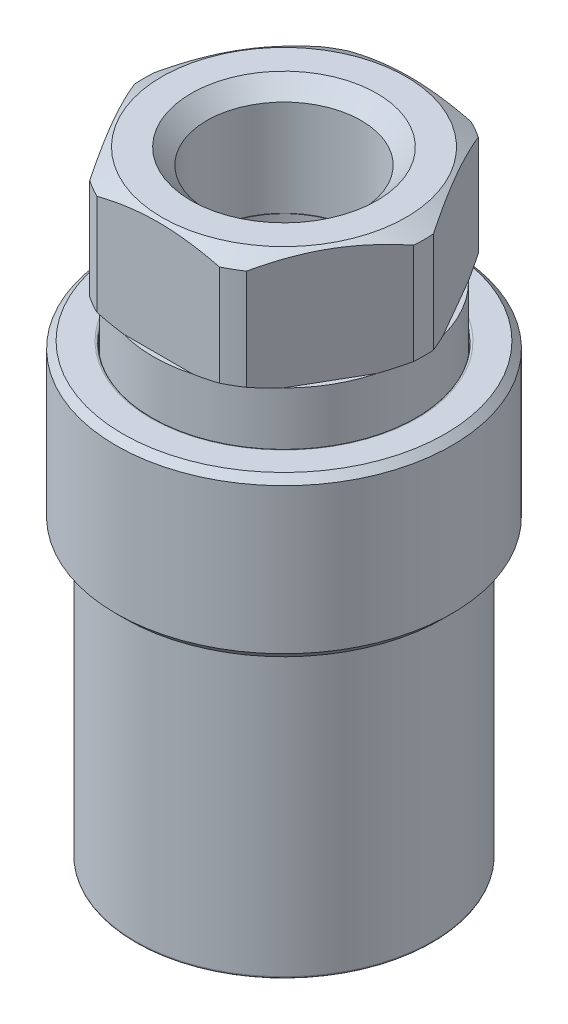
ISO-10303-21;
HEADER;
FILE_DESCRIPTION(('STEP AP214'),'2;1');
FILE_NAME('part.step','',(''),(''),'','','');
FILE_SCHEMA(('AUTOMOTIVE_DESIGN { 1 0 10303 214 1 1 1 1 }'));
ENDSEC;
DATA;
#1=APPLICATION_CONTEXT('core data for automotive mechanical design processes');
#2=APPLICATION_PROTOCOL_DEFINITION('international standard','automotive_design',2000,#1);
#3=PRODUCT_CONTEXT('',#1,'mechanical');
#4=PRODUCT('Part','Part','',(#3));
#5=PRODUCT_RELATED_PRODUCT_CATEGORY('part','',(#4));
#6=PRODUCT_DEFINITION_FORMATION('','',#4);
#7=PRODUCT_DEFINITION_CONTEXT('part definition',#1,'design');
#8=PRODUCT_DEFINITION('design','',#6,#7);
#9=PRODUCT_DEFINITION_SHAPE('','',#8);
#10=(LENGTH_UNIT() NAMED_UNIT(*) SI_UNIT(.MILLI.,.METRE.));
#11=(NAMED_UNIT(*) PLANE_ANGLE_UNIT() SI_UNIT($,.RADIAN.));
#12=(NAMED_UNIT(*) SI_UNIT($,.STERADIAN.) SOLID_ANGLE_UNIT());
#13=UNCERTAINTY_MEASURE_WITH_UNIT(LENGTH_MEASURE(1.E-05),#10,'distance_accuracy_value','');
#14=(GEOMETRIC_REPRESENTATION_CONTEXT(3) GLOBAL_UNCERTAINTY_ASSIGNED_CONTEXT((#13)) GLOBAL_UNIT_ASSIGNED_CONTEXT((#10,
#11,#12)) REPRESENTATION_CONTEXT('',''));
#15=CARTESIAN_POINT('',(0.,0.,0.));
#16=DIRECTION('',(0.,0.,1.));
#17=DIRECTION('',(1.,0.,0.));
#18=AXIS2_PLACEMENT_3D('',#15,#16,#17);
#19=CARTESIAN_POINT('',(0.,25.2095,0.));
#20=DIRECTION('',(0.,-1.,0.));
#21=DIRECTION('',(0.,0.,-1.));
#22=AXIS2_PLACEMENT_3D('',#19,#20,#21);
#23=CONICAL_SURFACE('',#22,9.3345,0.785398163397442);
#24=CARTESIAN_POINT('',(0.,25.4,0.));
#25=DIRECTION('',(0.,-1.,0.));
#26=DIRECTION('',(0.,0.,-1.));
#27=AXIS2_PLACEMENT_3D('',#24,#25,#26);
#28=CIRCLE('',#27,9.144);
#29=CARTESIAN_POINT('',(0.,25.4,9.144));
#30=VERTEX_POINT('',#29);
#31=EDGE_CURVE('P0_E11',#30,#30,#28,.T.);
#32=ORIENTED_EDGE('',*,*,#31,.T.);
#33=DIRECTION('',(0.,-0.707106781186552,0.707106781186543));
#34=VECTOR('',#33,1.);
#35=CARTESIAN_POINT('',(0.,25.2095,9.3345));
#36=LINE('',#35,#34);
#37=CARTESIAN_POINT('',(0.,25.019,9.525));
#38=VERTEX_POINT('',#37);
#39=EDGE_CURVE('P0_E27',#30,#38,#36,.T.);
#40=ORIENTED_EDGE('',*,*,#39,.T.);
#41=CARTESIAN_POINT('',(0.,25.019,0.));
#42=DIRECTION('',(0.,1.,0.));
#43=DIRECTION('',(0.,0.,-1.));
#44=AXIS2_PLACEMENT_3D('',#41,#42,#43);
#45=CIRCLE('',#44,9.525);
#46=CARTESIAN_POINT('',(0.,25.019,-9.525));
#47=VERTEX_POINT('',#46);
#48=EDGE_CURVE('P0_E188',#38,#47,#45,.T.);
#49=ORIENTED_EDGE('',*,*,#48,.T.);
#50=CARTESIAN_POINT('',(0.,25.019,0.));
#51=DIRECTION('',(0.,1.,0.));
#52=DIRECTION('',(0.,0.,-1.));
#53=AXIS2_PLACEMENT_3D('',#50,#51,#52);
#54=CIRCLE('',#53,9.525);
#55=EDGE_CURVE('P0_E178',#47,#38,#54,.T.);
#56=ORIENTED_EDGE('',*,*,#55,.T.);
#57=ORIENTED_EDGE('',*,*,#39,.F.);
#58=EDGE_LOOP('',(#32,#40,#49,#56,#57));
#59=FACE_BOUND('',#58,.T.);
#60=ADVANCED_FACE('P0_F16',(#59),#23,.T.);
#61=CARTESIAN_POINT('',(0.,20.828,0.));
#62=DIRECTION('',(0.,1.,0.));
#63=DIRECTION('',(0.,0.,1.));
#64=AXIS2_PLACEMENT_3D('',#61,#62,#63);
#65=CYLINDRICAL_SURFACE('',#64,9.525);
#66=ORIENTED_EDGE('',*,*,#48,.F.);
#67=ORIENTED_EDGE('',*,*,#55,.F.);
#68=DIRECTION('',(0.,-1.,0.));
#69=VECTOR('',#68,1.);
#70=CARTESIAN_POINT('',(0.,20.828,-9.525));
#71=LINE('',#70,#69);
#72=CARTESIAN_POINT('',(0.,16.764,-9.525));
#73=VERTEX_POINT('',#72);
#74=EDGE_CURVE('P0_E128',#47,#73,#71,.T.);
#75=ORIENTED_EDGE('',*,*,#74,.T.);
#76=CARTESIAN_POINT('',(0.,16.764,0.));
#77=DIRECTION('',(0.,-1.,0.));
#78=DIRECTION('',(0.,0.,-1.));
#79=AXIS2_PLACEMENT_3D('',#76,#77,#78);
#80=CIRCLE('',#79,9.525);
#81=CARTESIAN_POINT('',(0.,16.764,9.525));
#82=VERTEX_POINT('',#81);
#83=EDGE_CURVE('P0_E120',#82,#73,#80,.T.);
#84=ORIENTED_EDGE('',*,*,#83,.F.);
#85=CARTESIAN_POINT('',(0.,16.764,0.));
#86=DIRECTION('',(0.,-1.,0.));
#87=DIRECTION('',(0.,0.,-1.));
#88=AXIS2_PLACEMENT_3D('',#85,#86,#87);
#89=CIRCLE('',#88,9.525);
#90=EDGE_CURVE('P0_E114',#73,#82,#89,.T.);
#91=ORIENTED_EDGE('',*,*,#90,.F.);
#92=ORIENTED_EDGE('',*,*,#74,.F.);
#93=EDGE_LOOP('',(#66,#67,#75,#84,#91,#92));
#94=FACE_BOUND('',#93,.T.);
#95=ADVANCED_FACE('P0_F126',(#94),#65,.T.);
#96=CARTESIAN_POINT('',(0.,25.4,7.4549));
#97=DIRECTION('',(0.,1.,0.));
#98=DIRECTION('',(1.,0.,0.));
#99=AXIS2_PLACEMENT_3D('',#96,#97,#98);
#100=PLANE('',#99);
#101=ORIENTED_EDGE('',*,*,#31,.F.);
#102=EDGE_LOOP('',(#101));
#103=FACE_BOUND('',#102,.T.);
#104=CARTESIAN_POINT('',(0.,25.4,0.));
#105=DIRECTION('',(0.,1.,0.));
#106=DIRECTION('',(0.,0.,-1.));
#107=AXIS2_PLACEMENT_3D('',#104,#105,#106);
#108=CIRCLE('',#107,7.5819);
#109=CARTESIAN_POINT('',(0.,25.4,-7.5819));
#110=VERTEX_POINT('',#109);
#111=EDGE_CURVE('P0_E192',#110,#110,#108,.T.);
#112=ORIENTED_EDGE('',*,*,#111,.F.);
#113=EDGE_LOOP('',(#112));
#114=FACE_BOUND('',#113,.T.);
#115=ADVANCED_FACE('P0_F331',(#103,#114),#100,.T.);
#116=CARTESIAN_POINT('',(0.,6.096,0.));
#117=DIRECTION('',(0.,1.,0.));
#118=DIRECTION('',(0.,0.,1.));
#119=AXIS2_PLACEMENT_3D('',#116,#117,#118);
#120=TOROIDAL_SURFACE('',#119,6.6802,0.254);
#121=CARTESIAN_POINT('',(0.,6.096,0.));
#122=DIRECTION('',(0.,-1.,0.));
#123=DIRECTION('',(0.,0.,-1.));
#124=AXIS2_PLACEMENT_3D('',#121,#122,#123);
#125=CIRCLE('',#124,6.4262);
#126=CARTESIAN_POINT('',(0.,6.096,6.4262));
#127=VERTEX_POINT('',#126);
#128=CARTESIAN_POINT('',(0.,6.096,-6.4262));
#129=VERTEX_POINT('',#128);
#130=EDGE_CURVE('P0_E179',#127,#129,#125,.T.);
#131=ORIENTED_EDGE('',*,*,#130,.T.);
#132=CARTESIAN_POINT('',(0.,6.096,-6.6802));
#133=DIRECTION('',(-1.,0.,0.));
#134=DIRECTION('',(0.,0.,-1.));
#135=AXIS2_PLACEMENT_3D('',#132,#133,#134);
#136=CIRCLE('',#135,0.254);
#137=CARTESIAN_POINT('',(0.,6.35,-6.6802));
#138=VERTEX_POINT('',#137);
#139=EDGE_CURVE('P0_E249',#129,#138,#136,.T.);
#140=ORIENTED_EDGE('',*,*,#139,.T.);
#141=CARTESIAN_POINT('',(0.,6.35,0.));
#142=DIRECTION('',(0.,1.,0.));
#143=DIRECTION('',(0.,0.,-1.));
#144=AXIS2_PLACEMENT_3D('',#141,#142,#143);
#145=CIRCLE('',#144,6.6802);
#146=CARTESIAN_POINT('',(0.,6.35,6.6802));
#147=VERTEX_POINT('',#146);
#148=EDGE_CURVE('P0_E253',#138,#147,#145,.T.);
#149=ORIENTED_EDGE('',*,*,#148,.T.);
#150=CARTESIAN_POINT('',(0.,6.35,0.));
#151=DIRECTION('',(0.,1.,0.));
#152=DIRECTION('',(0.,0.,-1.));
#153=AXIS2_PLACEMENT_3D('',#150,#151,#152);
#154=CIRCLE('',#153,6.6802);
#155=EDGE_CURVE('P0_E260',#147,#138,#154,.T.);
#156=ORIENTED_EDGE('',*,*,#155,.T.);
#157=ORIENTED_EDGE('',*,*,#139,.F.);
#158=CARTESIAN_POINT('',(0.,6.096,0.));
#159=DIRECTION('',(0.,-1.,0.));
#160=DIRECTION('',(0.,0.,-1.));
#161=AXIS2_PLACEMENT_3D('',#158,#159,#160);
#162=CIRCLE('',#161,6.4262);
#163=EDGE_CURVE('P0_E143',#129,#127,#162,.T.);
#164=ORIENTED_EDGE('',*,*,#163,.T.);
#165=EDGE_LOOP('',(#131,#140,#149,#156,#157,#164));
#166=FACE_BOUND('',#165,.T.);
#167=ADVANCED_FACE('P0_F317',(#166),#120,.T.);
#168=CARTESIAN_POINT('',(0.,6.35,6.4262));
#169=DIRECTION('',(0.,1.,0.));
#170=DIRECTION('',(1.,0.,0.));
#171=AXIS2_PLACEMENT_3D('',#168,#169,#170);
#172=PLANE('',#171);
#173=CARTESIAN_POINT('',(0.,6.35,0.));
#174=DIRECTION('',(0.,-1.,0.));
#175=DIRECTION('',(0.,0.,-1.));
#176=AXIS2_PLACEMENT_3D('',#173,#174,#175);
#177=CIRCLE('',#176,7.2009);
#178=CARTESIAN_POINT('',(0.,6.35,7.2009));
#179=VERTEX_POINT('',#178);
#180=CARTESIAN_POINT('',(0.,6.35,-7.2009));
#181=VERTEX_POINT('',#180);
#182=EDGE_CURVE('P0_E218',#179,#181,#177,.T.);
#183=ORIENTED_EDGE('',*,*,#182,.F.);
#184=CARTESIAN_POINT('',(0.,6.35,0.));
#185=DIRECTION('',(0.,-1.,0.));
#186=DIRECTION('',(0.,0.,-1.));
#187=AXIS2_PLACEMENT_3D('',#184,#185,#186);
#188=CIRCLE('',#187,7.2009);
#189=EDGE_CURVE('P0_E238',#181,#179,#188,.T.);
#190=ORIENTED_EDGE('',*,*,#189,.F.);
#191=EDGE_LOOP('',(#183,#190));
#192=FACE_BOUND('',#191,.T.);
#193=ORIENTED_EDGE('',*,*,#155,.F.);
#194=ORIENTED_EDGE('',*,*,#148,.F.);
#195=EDGE_LOOP('',(#193,#194));
#196=FACE_BOUND('',#195,.T.);
#197=ADVANCED_FACE('P0_F320',(#192,#196),#172,.T.);
#198=CARTESIAN_POINT('',(0.,4.1402,0.));
#199=DIRECTION('',(0.,1.,0.));
#200=DIRECTION('',(0.,0.,1.));
#201=AXIS2_PLACEMENT_3D('',#198,#199,#200);
#202=CYLINDRICAL_SURFACE('',#201,6.4262);
#203=ORIENTED_EDGE('',*,*,#130,.F.);
#204=ORIENTED_EDGE('',*,*,#163,.F.);
#205=DIRECTION('',(0.,-1.,0.));
#206=VECTOR('',#205,1.);
#207=CARTESIAN_POINT('',(0.,4.1402,-6.4262));
#208=LINE('',#207,#206);
#209=CARTESIAN_POINT('',(0.,1.9304,-6.4262));
#210=VERTEX_POINT('',#209);
#211=EDGE_CURVE('P0_E270',#129,#210,#208,.T.);
#212=ORIENTED_EDGE('',*,*,#211,.T.);
#213=CARTESIAN_POINT('',(0.,1.9304,0.));
#214=DIRECTION('',(0.,1.,0.));
#215=DIRECTION('',(1.,0.,0.));
#216=AXIS2_PLACEMENT_3D('',#213,#214,#215);
#217=CIRCLE('',#216,6.4262);
#218=CARTESIAN_POINT('',(0.,1.9304,6.4262));
#219=VERTEX_POINT('',#218);
#220=EDGE_CURVE('P0_E159',#219,#210,#217,.T.);
#221=ORIENTED_EDGE('',*,*,#220,.F.);
#222=CARTESIAN_POINT('',(0.,1.9304,0.));
#223=DIRECTION('',(0.,1.,0.));
#224=DIRECTION('',(1.,0.,0.));
#225=AXIS2_PLACEMENT_3D('',#222,#223,#224);
#226=CIRCLE('',#225,6.4262);
#227=EDGE_CURVE('P0_E164',#210,#219,#226,.T.);
#228=ORIENTED_EDGE('',*,*,#227,.F.);
#229=ORIENTED_EDGE('',*,*,#211,.F.);
#230=EDGE_LOOP('',(#203,#204,#212,#221,#228,#229));
#231=FACE_BOUND('',#230,.T.);
#232=ADVANCED_FACE('P0_F310',(#231),#202,.F.);
#233=CARTESIAN_POINT('',(0.,6.604,0.));
#234=DIRECTION('',(0.,1.,0.));
#235=DIRECTION('',(0.,0.,1.));
#236=AXIS2_PLACEMENT_3D('',#233,#234,#235);
#237=TOROIDAL_SURFACE('',#236,7.2009,0.254);
#238=CARTESIAN_POINT('',(0.,6.604,0.));
#239=DIRECTION('',(0.,1.,0.));
#240=DIRECTION('',(0.,0.,-1.));
#241=AXIS2_PLACEMENT_3D('',#238,#239,#240);
#242=CIRCLE('',#241,7.4549);
#243=CARTESIAN_POINT('',(0.,6.604,7.4549));
#244=VERTEX_POINT('',#243);
#245=CARTESIAN_POINT('',(0.,6.604,-7.4549));
#246=VERTEX_POINT('',#245);
#247=EDGE_CURVE('P0_E267',#244,#246,#242,.T.);
#248=ORIENTED_EDGE('',*,*,#247,.T.);
#249=CARTESIAN_POINT('',(0.,6.604,-7.2009));
#250=DIRECTION('',(-1.,0.,0.));
#251=DIRECTION('',(0.,0.,-1.));
#252=AXIS2_PLACEMENT_3D('',#249,#250,#251);
#253=CIRCLE('',#252,0.254);
#254=EDGE_CURVE('P0_E20',#246,#181,#253,.T.);
#255=ORIENTED_EDGE('',*,*,#254,.T.);
#256=ORIENTED_EDGE('',*,*,#189,.T.);
#257=ORIENTED_EDGE('',*,*,#182,.T.);
#258=ORIENTED_EDGE('',*,*,#254,.F.);
#259=CARTESIAN_POINT('',(0.,6.604,0.));
#260=DIRECTION('',(0.,1.,0.));
#261=DIRECTION('',(0.,0.,-1.));
#262=AXIS2_PLACEMENT_3D('',#259,#260,#261);
#263=CIRCLE('',#262,7.4549);
#264=EDGE_CURVE('P0_E245',#246,#244,#263,.T.);
#265=ORIENTED_EDGE('',*,*,#264,.T.);
#266=EDGE_LOOP('',(#248,#255,#256,#257,#258,#265));
#267=FACE_BOUND('',#266,.T.);
#268=ADVANCED_FACE('P0_F329',(#267),#237,.F.);
#269=CARTESIAN_POINT('',(0.,15.875,0.));
#270=DIRECTION('',(0.,1.,0.));
#271=DIRECTION('',(0.,0.,1.));
#272=AXIS2_PLACEMENT_3D('',#269,#270,#271);
#273=CYLINDRICAL_SURFACE('',#272,7.4549);
#274=CARTESIAN_POINT('',(0.,25.273,0.));
#275=DIRECTION('',(0.,-1.,0.));
#276=DIRECTION('',(0.,0.,-1.));
#277=AXIS2_PLACEMENT_3D('',#274,#275,#276);
#278=CIRCLE('',#277,7.4549);
#279=CARTESIAN_POINT('',(0.,25.273,7.4549));
#280=VERTEX_POINT('',#279);
#281=CARTESIAN_POINT('',(0.,25.273,-7.4549));
#282=VERTEX_POINT('',#281);
#283=EDGE_CURVE('P0_E153',#280,#282,#278,.T.);
#284=ORIENTED_EDGE('',*,*,#283,.F.);
#285=CARTESIAN_POINT('',(0.,25.273,0.));
#286=DIRECTION('',(0.,-1.,0.));
#287=DIRECTION('',(0.,0.,-1.));
#288=AXIS2_PLACEMENT_3D('',#285,#286,#287);
#289=CIRCLE('',#288,7.4549);
#290=EDGE_CURVE('P0_E195',#282,#280,#289,.T.);
#291=ORIENTED_EDGE('',*,*,#290,.F.);
#292=DIRECTION('',(0.,-1.,0.));
#293=VECTOR('',#292,1.);
#294=CARTESIAN_POINT('',(0.,15.875,-7.4549));
#295=LINE('',#294,#293);
#296=EDGE_CURVE('P0_E130',#282,#246,#295,.T.);
#297=ORIENTED_EDGE('',*,*,#296,.T.);
#298=ORIENTED_EDGE('',*,*,#247,.F.);
#299=ORIENTED_EDGE('',*,*,#264,.F.);
#300=ORIENTED_EDGE('',*,*,#296,.F.);
#301=EDGE_LOOP('',(#284,#291,#297,#298,#299,#300));
#302=FACE_BOUND('',#301,.T.);
#303=ADVANCED_FACE('P0_F344',(#302),#273,.F.);
#304=CARTESIAN_POINT('',(0.,16.51,0.));
#305=DIRECTION('',(0.,1.,0.));
#306=DIRECTION('',(0.,0.,-1.));
#307=AXIS2_PLACEMENT_3D('',#304,#305,#306);
#308=CONICAL_SURFACE('',#307,9.271,0.785398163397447);
#309=ORIENTED_EDGE('',*,*,#83,.T.);
#310=ORIENTED_EDGE('',*,*,#90,.T.);
#311=DIRECTION('',(0.,-0.707106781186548,-0.707106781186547));
#312=VECTOR('',#311,1.);
#313=CARTESIAN_POINT('',(0.,16.51,9.271));
#314=LINE('',#313,#312);
#315=CARTESIAN_POINT('',(0.,16.256,9.017));
#316=VERTEX_POINT('',#315);
#317=EDGE_CURVE('P0_E119',#82,#316,#314,.T.);
#318=ORIENTED_EDGE('',*,*,#317,.T.);
#319=CARTESIAN_POINT('',(0.,16.256,0.));
#320=DIRECTION('',(0.,1.,0.));
#321=DIRECTION('',(0.,0.,-1.));
#322=AXIS2_PLACEMENT_3D('',#319,#320,#321);
#323=CIRCLE('',#322,9.017);
#324=EDGE_CURVE('P0_E132',#316,#316,#323,.T.);
#325=ORIENTED_EDGE('',*,*,#324,.T.);
#326=ORIENTED_EDGE('',*,*,#317,.F.);
#327=EDGE_LOOP('',(#309,#310,#318,#325,#326));
#328=FACE_BOUND('',#327,.T.);
#329=ADVANCED_FACE('P0_F116',(#328),#308,.T.);
#330=CARTESIAN_POINT('',(0.,16.256,9.525));
#331=DIRECTION('',(0.,-1.,0.));
#332=DIRECTION('',(0.,0.,-1.));
#333=AXIS2_PLACEMENT_3D('',#330,#331,#332);
#334=PLANE('',#333);
#335=ORIENTED_EDGE('',*,*,#324,.F.);
#336=EDGE_LOOP('',(#335));
#337=FACE_BOUND('',#336,.T.);
#338=CARTESIAN_POINT('',(0.,16.256,0.));
#339=DIRECTION('',(0.,1.,0.));
#340=DIRECTION('',(1.,0.,0.));
#341=AXIS2_PLACEMENT_3D('',#338,#339,#340);
#342=CIRCLE('',#341,8.4328);
#343=CARTESIAN_POINT('',(0.,16.256,8.4328));
#344=VERTEX_POINT('',#343);
#345=CARTESIAN_POINT('',(0.,16.256,-8.4328));
#346=VERTEX_POINT('',#345);
#347=EDGE_CURVE('P0_E139',#344,#346,#342,.T.);
#348=ORIENTED_EDGE('',*,*,#347,.T.);
#349=CARTESIAN_POINT('',(0.,16.256,0.));
#350=DIRECTION('',(0.,1.,0.));
#351=DIRECTION('',(1.,0.,0.));
#352=AXIS2_PLACEMENT_3D('',#349,#350,#351);
#353=CIRCLE('',#352,8.4328);
#354=EDGE_CURVE('P0_E147',#346,#344,#353,.T.);
#355=ORIENTED_EDGE('',*,*,#354,.T.);
#356=EDGE_LOOP('',(#348,#355));
#357=FACE_BOUND('',#356,.T.);
#358=ADVANCED_FACE('P0_F359',(#337,#357),#334,.T.);
#359=CARTESIAN_POINT('',(0.,0.127,0.));
#360=DIRECTION('',(0.,1.,0.));
#361=DIRECTION('',(0.,0.,1.));
#362=AXIS2_PLACEMENT_3D('',#359,#360,#361);
#363=TOROIDAL_SURFACE('',#362,8.3058,0.127);
#364=CARTESIAN_POINT('',(0.,0.127,0.));
#365=DIRECTION('',(0.,-1.,0.));
#366=DIRECTION('',(0.,0.,-1.));
#367=AXIS2_PLACEMENT_3D('',#364,#365,#366);
#368=CIRCLE('',#367,8.4328);
#369=CARTESIAN_POINT('',(0.,0.127,8.4328));
#370=VERTEX_POINT('',#369);
#371=CARTESIAN_POINT('',(0.,0.127,-8.4328));
#372=VERTEX_POINT('',#371);
#373=EDGE_CURVE('P0_E234',#370,#372,#368,.T.);
#374=ORIENTED_EDGE('',*,*,#373,.T.);
#375=CARTESIAN_POINT('',(0.,0.127,-8.3058));
#376=DIRECTION('',(-1.,0.,0.));
#377=DIRECTION('',(0.,0.,-1.));
#378=AXIS2_PLACEMENT_3D('',#375,#376,#377);
#379=CIRCLE('',#378,0.127);
#380=CARTESIAN_POINT('',(0.,0.,-8.3058));
#381=VERTEX_POINT('',#380);
#382=EDGE_CURVE('P0_E230',#372,#381,#379,.T.);
#383=ORIENTED_EDGE('',*,*,#382,.T.);
#384=CARTESIAN_POINT('',(0.,0.,0.));
#385=DIRECTION('',(0.,1.,0.));
#386=DIRECTION('',(0.,0.,-1.));
#387=AXIS2_PLACEMENT_3D('',#384,#385,#386);
#388=CIRCLE('',#387,8.3058);
#389=CARTESIAN_POINT('',(0.,0.,8.3058));
#390=VERTEX_POINT('',#389);
#391=EDGE_CURVE('P0_E169',#381,#390,#388,.T.);
#392=ORIENTED_EDGE('',*,*,#391,.T.);
#393=CARTESIAN_POINT('',(0.,0.,0.));
#394=DIRECTION('',(0.,1.,0.));
#395=DIRECTION('',(0.,0.,-1.));
#396=AXIS2_PLACEMENT_3D('',#393,#394,#395);
#397=CIRCLE('',#396,8.3058);
#398=EDGE_CURVE('P0_E165',#390,#381,#397,.T.);
#399=ORIENTED_EDGE('',*,*,#398,.T.);
#400=ORIENTED_EDGE('',*,*,#382,.F.);
#401=CARTESIAN_POINT('',(0.,0.127,0.));
#402=DIRECTION('',(0.,-1.,0.));
#403=DIRECTION('',(0.,0.,-1.));
#404=AXIS2_PLACEMENT_3D('',#401,#402,#403);
#405=CIRCLE('',#404,8.4328);
#406=EDGE_CURVE('P0_E152',#372,#370,#405,.T.);
#407=ORIENTED_EDGE('',*,*,#406,.T.);
#408=EDGE_LOOP('',(#374,#383,#392,#399,#400,#407));
#409=FACE_BOUND('',#408,.T.);
#410=ADVANCED_FACE('P0_F356',(#409),#363,.T.);
#411=CARTESIAN_POINT('',(0.,0.,8.4328));
#412=DIRECTION('',(0.,-1.,0.));
#413=DIRECTION('',(0.,0.,-1.));
#414=AXIS2_PLACEMENT_3D('',#411,#412,#413);
#415=PLANE('',#414);
#416=ORIENTED_EDGE('',*,*,#398,.F.);
#417=ORIENTED_EDGE('',*,*,#391,.F.);
#418=EDGE_LOOP('',(#416,#417));
#419=FACE_BOUND('',#418,.T.);
#420=CARTESIAN_POINT('',(0.,0.,0.));
#421=DIRECTION('',(0.,-1.,0.));
#422=DIRECTION('',(0.,0.,-1.));
#423=AXIS2_PLACEMENT_3D('',#420,#421,#422);
#424=CIRCLE('',#423,7.4422);
#425=CARTESIAN_POINT('',(0.,0.,7.4422));
#426=VERTEX_POINT('',#425);
#427=CARTESIAN_POINT('',(0.,0.,-7.4422));
#428=VERTEX_POINT('',#427);
#429=EDGE_CURVE('P0_E206',#426,#428,#424,.T.);
#430=ORIENTED_EDGE('',*,*,#429,.F.);
#431=CARTESIAN_POINT('',(0.,0.,0.));
#432=DIRECTION('',(0.,-1.,0.));
#433=DIRECTION('',(0.,0.,-1.));
#434=AXIS2_PLACEMENT_3D('',#431,#432,#433);
#435=CIRCLE('',#434,7.4422);
#436=EDGE_CURVE('P0_E184',#428,#426,#435,.T.);
#437=ORIENTED_EDGE('',*,*,#436,.F.);
#438=EDGE_LOOP('',(#430,#437));
#439=FACE_BOUND('',#438,.T.);
#440=ADVANCED_FACE('P0_F351',(#419,#439),#415,.T.);
#441=CARTESIAN_POINT('',(0.,8.128,0.));
#442=DIRECTION('',(0.,1.,0.));
#443=DIRECTION('',(0.,0.,1.));
#444=AXIS2_PLACEMENT_3D('',#441,#442,#443);
#445=CYLINDRICAL_SURFACE('',#444,8.4328);
#446=ORIENTED_EDGE('',*,*,#347,.F.);
#447=ORIENTED_EDGE('',*,*,#354,.F.);
#448=DIRECTION('',(0.,-1.,0.));
#449=VECTOR('',#448,1.);
#450=CARTESIAN_POINT('',(0.,8.128,-8.4328));
#451=LINE('',#450,#449);
#452=EDGE_CURVE('P0_E148',#346,#372,#451,.T.);
#453=ORIENTED_EDGE('',*,*,#452,.T.);
#454=ORIENTED_EDGE('',*,*,#373,.F.);
#455=ORIENTED_EDGE('',*,*,#406,.F.);
#456=ORIENTED_EDGE('',*,*,#452,.F.);
#457=EDGE_LOOP('',(#446,#447,#453,#454,#455,#456));
#458=FACE_BOUND('',#457,.T.);
#459=ADVANCED_FACE('P0_F348',(#458),#445,.T.);
#460=CARTESIAN_POINT('',(0.,25.273,0.));
#461=DIRECTION('',(0.,1.,0.));
#462=DIRECTION('',(0.,0.,1.));
#463=AXIS2_PLACEMENT_3D('',#460,#461,#462);
#464=TOROIDAL_SURFACE('',#463,7.5819,0.127);
#465=ORIENTED_EDGE('',*,*,#283,.T.);
#466=CARTESIAN_POINT('',(0.,25.273,-7.5819));
#467=DIRECTION('',(-1.,0.,0.));
#468=DIRECTION('',(0.,0.,-1.));
#469=AXIS2_PLACEMENT_3D('',#466,#467,#468);
#470=CIRCLE('',#469,0.127);
#471=EDGE_CURVE('P0_E191',#282,#110,#470,.T.);
#472=ORIENTED_EDGE('',*,*,#471,.T.);
#473=ORIENTED_EDGE('',*,*,#111,.T.);
#474=ORIENTED_EDGE('',*,*,#471,.F.);
#475=ORIENTED_EDGE('',*,*,#290,.T.);
#476=EDGE_LOOP('',(#465,#472,#473,#474,#475));
#477=FACE_BOUND('',#476,.T.);
#478=ADVANCED_FACE('P0_F18',(#477),#464,.T.);
#479=CARTESIAN_POINT('',(0.,0.127,0.));
#480=DIRECTION('',(0.,1.,0.));
#481=DIRECTION('',(0.,0.,1.));
#482=AXIS2_PLACEMENT_3D('',#479,#480,#481);
#483=TOROIDAL_SURFACE('',#482,7.4422,0.127);
#484=ORIENTED_EDGE('',*,*,#429,.T.);
#485=CARTESIAN_POINT('',(0.,0.127,-7.4422));
#486=DIRECTION('',(-1.,0.,0.));
#487=DIRECTION('',(0.,0.,-1.));
#488=AXIS2_PLACEMENT_3D('',#485,#486,#487);
#489=CIRCLE('',#488,0.127);
#490=CARTESIAN_POINT('',(0.,0.127,-7.3152));
#491=VERTEX_POINT('',#490);
#492=EDGE_CURVE('P0_E174',#428,#491,#489,.T.);
#493=ORIENTED_EDGE('',*,*,#492,.T.);
#494=CARTESIAN_POINT('',(0.,0.127,0.));
#495=DIRECTION('',(0.,1.,0.));
#496=DIRECTION('',(0.,0.,-1.));
#497=AXIS2_PLACEMENT_3D('',#494,#495,#496);
#498=CIRCLE('',#497,7.3152);
#499=CARTESIAN_POINT('',(0.,0.127,7.3152));
#500=VERTEX_POINT('',#499);
#501=EDGE_CURVE('P0_E170',#491,#500,#498,.T.);
#502=ORIENTED_EDGE('',*,*,#501,.T.);
#503=CARTESIAN_POINT('',(0.,0.127,0.));
#504=DIRECTION('',(0.,1.,0.));
#505=DIRECTION('',(0.,0.,-1.));
#506=AXIS2_PLACEMENT_3D('',#503,#504,#505);
#507=CIRCLE('',#506,7.3152);
#508=EDGE_CURVE('P0_E175',#500,#491,#507,.T.);
#509=ORIENTED_EDGE('',*,*,#508,.T.);
#510=ORIENTED_EDGE('',*,*,#492,.F.);
#511=ORIENTED_EDGE('',*,*,#436,.T.);
#512=EDGE_LOOP('',(#484,#493,#502,#509,#510,#511));
#513=FACE_BOUND('',#512,.T.);
#514=ADVANCED_FACE('P0_F291',(#513),#483,.T.);
#515=CARTESIAN_POINT('',(0.,0.5207,0.));
#516=DIRECTION('',(0.,1.,0.));
#517=DIRECTION('',(0.,0.,1.));
#518=AXIS2_PLACEMENT_3D('',#515,#516,#517);
#519=CYLINDRICAL_SURFACE('',#518,7.3152);
#520=CARTESIAN_POINT('',(0.,1.0414,0.));
#521=DIRECTION('',(0.,1.,0.));
#522=DIRECTION('',(1.,0.,0.));
#523=AXIS2_PLACEMENT_3D('',#520,#521,#522);
#524=CIRCLE('',#523,7.3152);
#525=CARTESIAN_POINT('',(0.,1.0414,7.3152));
#526=VERTEX_POINT('',#525);
#527=CARTESIAN_POINT('',(0.,1.0414,-7.3152));
#528=VERTEX_POINT('',#527);
#529=EDGE_CURVE('P0_E180',#526,#528,#524,.T.);
#530=ORIENTED_EDGE('',*,*,#529,.T.);
#531=DIRECTION('',(0.,-1.,0.));
#532=VECTOR('',#531,1.);
#533=CARTESIAN_POINT('',(0.,0.5207,-7.3152));
#534=LINE('',#533,#532);
#535=EDGE_CURVE('P0_E158',#528,#491,#534,.T.);
#536=ORIENTED_EDGE('',*,*,#535,.T.);
#537=ORIENTED_EDGE('',*,*,#508,.F.);
#538=ORIENTED_EDGE('',*,*,#501,.F.);
#539=ORIENTED_EDGE('',*,*,#535,.F.);
#540=CARTESIAN_POINT('',(0.,1.0414,0.));
#541=DIRECTION('',(0.,1.,0.));
#542=DIRECTION('',(1.,0.,0.));
#543=AXIS2_PLACEMENT_3D('',#540,#541,#542);
#544=CIRCLE('',#543,7.3152);
#545=EDGE_CURVE('P0_E154',#528,#526,#544,.T.);
#546=ORIENTED_EDGE('',*,*,#545,.T.);
#547=EDGE_LOOP('',(#530,#536,#537,#538,#539,#546));
#548=FACE_BOUND('',#547,.T.);
#549=ADVANCED_FACE('P0_F298',(#548),#519,.F.);
#550=CARTESIAN_POINT('',(0.,1.4859,0.));
#551=DIRECTION('',(0.,-1.,0.));
#552=DIRECTION('',(0.,0.,1.));
#553=AXIS2_PLACEMENT_3D('',#550,#551,#552);
#554=CONICAL_SURFACE('',#553,6.8707,0.78539816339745);
#555=ORIENTED_EDGE('',*,*,#220,.T.);
#556=DIRECTION('',(0.,-0.707106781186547,-0.707106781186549));
#557=VECTOR('',#556,1.);
#558=CARTESIAN_POINT('',(0.,1.4859,-6.8707));
#559=LINE('',#558,#557);
#560=EDGE_CURVE('P0_E160',#210,#528,#559,.T.);
#561=ORIENTED_EDGE('',*,*,#560,.T.);
#562=ORIENTED_EDGE('',*,*,#529,.F.);
#563=ORIENTED_EDGE('',*,*,#545,.F.);
#564=ORIENTED_EDGE('',*,*,#560,.F.);
#565=ORIENTED_EDGE('',*,*,#227,.T.);
#566=EDGE_LOOP('',(#555,#561,#562,#563,#564,#565));
#567=FACE_BOUND('',#566,.T.);
#568=ADVANCED_FACE('P0_F301',(#567),#554,.F.);
#569=CLOSED_SHELL('',(#60,#95,#115,#167,#197,#232,#268,#303,#329,#358,#410,#440,#459,#478,#514,
#549,#568));
#570=MANIFOLD_SOLID_BREP('P0_B1',#569);
#571=CARTESIAN_POINT('',(0.,0.254,0.));
#572=DIRECTION('',(0.,1.,0.));
#573=DIRECTION('',(0.,0.,1.));
#574=AXIS2_PLACEMENT_3D('',#571,#572,#573);
#575=TOROIDAL_SURFACE('',#574,6.09600000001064,0.254);
#576=CARTESIAN_POINT('',(0.,0.254,0.));
#577=DIRECTION('',(0.,-1.,0.));
#578=DIRECTION('',(0.,0.,-1.));
#579=AXIS2_PLACEMENT_3D('',#576,#577,#578);
#580=CIRCLE('',#579,6.35000000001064);
#581=CARTESIAN_POINT('',(0.,0.254,6.35000000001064));
#582=VERTEX_POINT('',#581);
#583=CARTESIAN_POINT('',(0.,0.254,-6.35000000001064));
#584=VERTEX_POINT('',#583);
#585=EDGE_CURVE('P1_E11',#582,#584,#580,.T.);
#586=ORIENTED_EDGE('',*,*,#585,.T.);
#587=CARTESIAN_POINT('',(0.,0.254,-6.09600000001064));
#588=DIRECTION('',(-1.,0.,0.));
#589=DIRECTION('',(0.,0.,-1.));
#590=AXIS2_PLACEMENT_3D('',#587,#588,#589);
#591=CIRCLE('',#590,0.254);
#592=CARTESIAN_POINT('',(0.,0.,-6.09600000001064));
#593=VERTEX_POINT('',#592);
#594=EDGE_CURVE('P1_E27',#584,#593,#591,.T.);
#595=ORIENTED_EDGE('',*,*,#594,.T.);
#596=CARTESIAN_POINT('',(0.,0.,0.));
#597=DIRECTION('',(0.,1.,0.));
#598=DIRECTION('',(0.,0.,-1.));
#599=AXIS2_PLACEMENT_3D('',#596,#597,#598);
#600=CIRCLE('',#599,6.09600000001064);
#601=CARTESIAN_POINT('',(0.,0.,6.09600000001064));
#602=VERTEX_POINT('',#601);
#603=EDGE_CURVE('P1_E423',#593,#602,#600,.T.);
#604=ORIENTED_EDGE('',*,*,#603,.T.);
#605=CARTESIAN_POINT('',(0.,0.,0.));
#606=DIRECTION('',(0.,1.,0.));
#607=DIRECTION('',(0.,0.,-1.));
#608=AXIS2_PLACEMENT_3D('',#605,#606,#607);
#609=CIRCLE('',#608,6.09600000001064);
#610=EDGE_CURVE('P1_E430',#602,#593,#609,.T.);
#611=ORIENTED_EDGE('',*,*,#610,.T.);
#612=ORIENTED_EDGE('',*,*,#594,.F.);
#613=CARTESIAN_POINT('',(0.,0.254,0.));
#614=DIRECTION('',(0.,-1.,0.));
#615=DIRECTION('',(0.,0.,-1.));
#616=AXIS2_PLACEMENT_3D('',#613,#614,#615);
#617=CIRCLE('',#616,6.35000000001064);
#618=EDGE_CURVE('P1_E41',#584,#582,#617,.T.);
#619=ORIENTED_EDGE('',*,*,#618,.T.);
#620=EDGE_LOOP('',(#586,#595,#604,#611,#612,#619));
#621=FACE_BOUND('',#620,.T.);
#622=ADVANCED_FACE('P1_F16',(#621),#575,.T.);
#623=CARTESIAN_POINT('',(0.,0.,6.35000000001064));
#624=DIRECTION('',(0.,-1.,0.));
#625=DIRECTION('',(0.,0.,-1.));
#626=AXIS2_PLACEMENT_3D('',#623,#624,#625);
#627=PLANE('',#626);
#628=ORIENTED_EDGE('',*,*,#610,.F.);
#629=ORIENTED_EDGE('',*,*,#603,.F.);
#630=EDGE_LOOP('',(#628,#629));
#631=FACE_BOUND('',#630,.T.);
#632=CARTESIAN_POINT('',(0.,0.,0.));
#633=DIRECTION('',(0.,-1.,0.));
#634=DIRECTION('',(0.,0.,-1.));
#635=AXIS2_PLACEMENT_3D('',#632,#633,#634);
#636=CIRCLE('',#635,5.5372);
#637=CARTESIAN_POINT('',(0.,0.,5.5372));
#638=VERTEX_POINT('',#637);
#639=EDGE_CURVE('P1_E515',#638,#638,#636,.T.);
#640=ORIENTED_EDGE('',*,*,#639,.F.);
#641=EDGE_LOOP('',(#640));
#642=FACE_BOUND('',#641,.T.);
#643=ADVANCED_FACE('P1_F893',(#631,#642),#627,.T.);
#644=CARTESIAN_POINT('',(0.,7.62,0.));
#645=DIRECTION('',(0.,1.,0.));
#646=DIRECTION('',(0.,0.,1.));
#647=AXIS2_PLACEMENT_3D('',#644,#645,#646);
#648=CYLINDRICAL_SURFACE('',#647,6.35000000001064);
#649=CARTESIAN_POINT('',(0.,15.24,0.));
#650=DIRECTION('',(0.,1.,0.));
#651=DIRECTION('',(1.,0.,0.));
#652=AXIS2_PLACEMENT_3D('',#649,#650,#651);
#653=CIRCLE('',#652,6.35000000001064);
#654=CARTESIAN_POINT('',(0.,15.24,6.35000000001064));
#655=VERTEX_POINT('',#654);
#656=CARTESIAN_POINT('',(0.,15.24,-6.35000000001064));
#657=VERTEX_POINT('',#656);
#658=EDGE_CURVE('P1_E457',#655,#657,#653,.T.);
#659=ORIENTED_EDGE('',*,*,#658,.F.);
#660=CARTESIAN_POINT('',(0.,15.24,0.));
#661=DIRECTION('',(0.,1.,0.));
#662=DIRECTION('',(1.,0.,0.));
#663=AXIS2_PLACEMENT_3D('',#660,#661,#662);
#664=CIRCLE('',#663,6.35000000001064);
#665=EDGE_CURVE('P1_E462',#657,#655,#664,.T.);
#666=ORIENTED_EDGE('',*,*,#665,.F.);
#667=DIRECTION('',(0.,-1.,0.));
#668=VECTOR('',#667,1.);
#669=CARTESIAN_POINT('',(0.,7.62,-6.35000000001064));
#670=LINE('',#669,#668);
#671=EDGE_CURVE('P1_E433',#657,#584,#670,.T.);
#672=ORIENTED_EDGE('',*,*,#671,.T.);
#673=ORIENTED_EDGE('',*,*,#585,.F.);
#674=ORIENTED_EDGE('',*,*,#618,.F.);
#675=ORIENTED_EDGE('',*,*,#671,.F.);
#676=EDGE_LOOP('',(#659,#666,#672,#673,#674,#675));
#677=FACE_BOUND('',#676,.T.);
#678=ADVANCED_FACE('P1_F871',(#677),#648,.T.);
#679=CARTESIAN_POINT('',(0.,13.1064,0.));
#680=DIRECTION('',(0.,1.,0.));
#681=DIRECTION('',(0.,0.,1.));
#682=AXIS2_PLACEMENT_3D('',#679,#680,#681);
#683=TOROIDAL_SURFACE('',#682,3.8227,0.254);
#684=CARTESIAN_POINT('',(0.,12.8524,0.));
#685=DIRECTION('',(0.,-1.,0.));
#686=DIRECTION('',(0.,0.,-1.));
#687=AXIS2_PLACEMENT_3D('',#684,#685,#686);
#688=CIRCLE('',#687,3.8227);
#689=CARTESIAN_POINT('',(0.,12.8524,3.8227));
#690=VERTEX_POINT('',#689);
#691=CARTESIAN_POINT('',(0.,12.8524,-3.8227));
#692=VERTEX_POINT('',#691);
#693=EDGE_CURVE('P1_E756',#690,#692,#688,.T.);
#694=ORIENTED_EDGE('',*,*,#693,.T.);
#695=CARTESIAN_POINT('',(0.,13.1064,-3.8227));
#696=DIRECTION('',(-1.,0.,0.));
#697=DIRECTION('',(0.,0.,-1.));
#698=AXIS2_PLACEMENT_3D('',#695,#696,#697);
#699=CIRCLE('',#698,0.254);
#700=CARTESIAN_POINT('',(0.,13.1064,-3.5687));
#701=VERTEX_POINT('',#700);
#702=EDGE_CURVE('P1_E752',#692,#701,#699,.T.);
#703=ORIENTED_EDGE('',*,*,#702,.T.);
#704=CARTESIAN_POINT('',(0.,13.1064,0.));
#705=DIRECTION('',(0.,1.,0.));
#706=DIRECTION('',(0.,0.,-1.));
#707=AXIS2_PLACEMENT_3D('',#704,#705,#706);
#708=CIRCLE('',#707,3.5687);
#709=CARTESIAN_POINT('',(0.,13.1064,3.5687));
#710=VERTEX_POINT('',#709);
#711=EDGE_CURVE('P1_E757',#701,#710,#708,.T.);
#712=ORIENTED_EDGE('',*,*,#711,.T.);
#713=CARTESIAN_POINT('',(0.,13.1064,0.));
#714=DIRECTION('',(0.,1.,0.));
#715=DIRECTION('',(0.,0.,-1.));
#716=AXIS2_PLACEMENT_3D('',#713,#714,#715);
#717=CIRCLE('',#716,3.5687);
#718=EDGE_CURVE('P1_E353',#710,#701,#717,.T.);
#719=ORIENTED_EDGE('',*,*,#718,.T.);
#720=ORIENTED_EDGE('',*,*,#702,.F.);
#721=CARTESIAN_POINT('',(0.,12.8524,0.));
#722=DIRECTION('',(0.,-1.,0.));
#723=DIRECTION('',(0.,0.,-1.));
#724=AXIS2_PLACEMENT_3D('',#721,#722,#723);
#725=CIRCLE('',#724,3.8227);
#726=EDGE_CURVE('P1_E346',#692,#690,#725,.T.);
#727=ORIENTED_EDGE('',*,*,#726,.T.);
#728=EDGE_LOOP('',(#694,#703,#712,#719,#720,#727));
#729=FACE_BOUND('',#728,.T.);
#730=ADVANCED_FACE('P1_F958',(#729),#683,.T.);
#731=CARTESIAN_POINT('',(0.,19.2024,0.));
#732=DIRECTION('',(0.,1.,0.));
#733=DIRECTION('',(0.,0.,1.));
#734=AXIS2_PLACEMENT_3D('',#731,#732,#733);
#735=CYLINDRICAL_SURFACE('',#734,3.5687);
#736=CARTESIAN_POINT('',(0.,24.4399003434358,0.));
#737=DIRECTION('',(0.,1.,0.));
#738=DIRECTION('',(0.,0.,1.));
#739=AXIS2_PLACEMENT_3D('',#736,#737,#738);
#740=CIRCLE('',#739,3.5687);
#741=CARTESIAN_POINT('',(0.,24.4399003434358,-3.5687));
#742=VERTEX_POINT('',#741);
#743=EDGE_CURVE('P1_E354',#742,#742,#740,.T.);
#744=ORIENTED_EDGE('',*,*,#743,.T.);
#745=DIRECTION('',(0.,-1.,0.));
#746=VECTOR('',#745,1.);
#747=CARTESIAN_POINT('',(0.,19.2024,-3.5687));
#748=LINE('',#747,#746);
#749=EDGE_CURVE('P1_E485',#742,#701,#748,.T.);
#750=ORIENTED_EDGE('',*,*,#749,.T.);
#751=ORIENTED_EDGE('',*,*,#718,.F.);
#752=ORIENTED_EDGE('',*,*,#711,.F.);
#753=ORIENTED_EDGE('',*,*,#749,.F.);
#754=EDGE_LOOP('',(#744,#750,#751,#752,#753));
#755=FACE_BOUND('',#754,.T.);
#756=ADVANCED_FACE('P1_F994',(#755),#735,.F.);
#757=CARTESIAN_POINT('',(0.,12.8524,5.0546));
#758=DIRECTION('',(0.,-1.,0.));
#759=DIRECTION('',(0.,0.,-1.));
#760=AXIS2_PLACEMENT_3D('',#757,#758,#759);
#761=PLANE('',#760);
#762=CARTESIAN_POINT('',(0.,12.8524,0.));
#763=DIRECTION('',(0.,1.,0.));
#764=DIRECTION('',(1.,0.,0.));
#765=AXIS2_PLACEMENT_3D('',#762,#763,#764);
#766=CIRCLE('',#765,5.0546);
#767=CARTESIAN_POINT('',(0.,12.8524,5.0546));
#768=VERTEX_POINT('',#767);
#769=CARTESIAN_POINT('',(0.,12.8524,-5.0546));
#770=VERTEX_POINT('',#769);
#771=EDGE_CURVE('P1_E329',#768,#770,#766,.T.);
#772=ORIENTED_EDGE('',*,*,#771,.F.);
#773=CARTESIAN_POINT('',(0.,12.8524,0.));
#774=DIRECTION('',(0.,1.,0.));
#775=DIRECTION('',(1.,0.,0.));
#776=AXIS2_PLACEMENT_3D('',#773,#774,#775);
#777=CIRCLE('',#776,5.0546);
#778=EDGE_CURVE('P1_E724',#770,#768,#777,.T.);
#779=ORIENTED_EDGE('',*,*,#778,.F.);
#780=EDGE_LOOP('',(#772,#779));
#781=FACE_BOUND('',#780,.T.);
#782=ORIENTED_EDGE('',*,*,#693,.F.);
#783=ORIENTED_EDGE('',*,*,#726,.F.);
#784=EDGE_LOOP('',(#782,#783));
#785=FACE_BOUND('',#784,.T.);
#786=ADVANCED_FACE('P1_F886',(#781,#785),#761,.T.);
#787=CARTESIAN_POINT('',(0.,15.494,0.));
#788=DIRECTION('',(0.,1.,0.));
#789=DIRECTION('',(0.,0.,1.));
#790=AXIS2_PLACEMENT_3D('',#787,#788,#789);
#791=TOROIDAL_SURFACE('',#790,7.1501,0.254);
#792=CARTESIAN_POINT('',(0.,15.494,0.));
#793=DIRECTION('',(0.,-1.,0.));
#794=DIRECTION('',(0.,0.,-1.));
#795=AXIS2_PLACEMENT_3D('',#792,#793,#794);
#796=CIRCLE('',#795,7.4041);
#797=CARTESIAN_POINT('',(0.,15.494,7.4041));
#798=VERTEX_POINT('',#797);
#799=CARTESIAN_POINT('',(0.,15.494,-7.4041));
#800=VERTEX_POINT('',#799);
#801=EDGE_CURVE('P1_E489',#798,#800,#796,.T.);
#802=ORIENTED_EDGE('',*,*,#801,.T.);
#803=CARTESIAN_POINT('',(0.,15.494,-7.1501));
#804=DIRECTION('',(-1.,0.,0.));
#805=DIRECTION('',(0.,0.,-1.));
#806=AXIS2_PLACEMENT_3D('',#803,#804,#805);
#807=CIRCLE('',#806,0.254);
#808=CARTESIAN_POINT('',(0.,15.24,-7.1501));
#809=VERTEX_POINT('',#808);
#810=EDGE_CURVE('P1_E551',#800,#809,#807,.T.);
#811=ORIENTED_EDGE('',*,*,#810,.T.);
#812=CARTESIAN_POINT('',(0.,15.24,0.));
#813=DIRECTION('',(0.,1.,0.));
#814=DIRECTION('',(0.,0.,-1.));
#815=AXIS2_PLACEMENT_3D('',#812,#813,#814);
#816=CIRCLE('',#815,7.1501);
#817=CARTESIAN_POINT('',(0.,15.24,7.1501));
#818=VERTEX_POINT('',#817);
#819=EDGE_CURVE('P1_E591',#809,#818,#816,.T.);
#820=ORIENTED_EDGE('',*,*,#819,.T.);
#821=CARTESIAN_POINT('',(0.,15.24,0.));
#822=DIRECTION('',(0.,1.,0.));
#823=DIRECTION('',(0.,0.,-1.));
#824=AXIS2_PLACEMENT_3D('',#821,#822,#823);
#825=CIRCLE('',#824,7.1501);
#826=EDGE_CURVE('P1_E587',#818,#809,#825,.T.);
#827=ORIENTED_EDGE('',*,*,#826,.T.);
#828=ORIENTED_EDGE('',*,*,#810,.F.);
#829=CARTESIAN_POINT('',(0.,15.494,0.));
#830=DIRECTION('',(0.,-1.,0.));
#831=DIRECTION('',(0.,0.,-1.));
#832=AXIS2_PLACEMENT_3D('',#829,#830,#831);
#833=CIRCLE('',#832,7.4041);
#834=EDGE_CURVE('P1_E461',#800,#798,#833,.T.);
#835=ORIENTED_EDGE('',*,*,#834,.T.);
#836=EDGE_LOOP('',(#802,#811,#820,#827,#828,#835));
#837=FACE_BOUND('',#836,.T.);
#838=ADVANCED_FACE('P1_F876',(#837),#791,.T.);
#839=CARTESIAN_POINT('',(0.,15.24,7.4041));
#840=DIRECTION('',(0.,-1.,0.));
#841=DIRECTION('',(0.,0.,-1.));
#842=AXIS2_PLACEMENT_3D('',#839,#840,#841);
#843=PLANE('',#842);
#844=ORIENTED_EDGE('',*,*,#826,.F.);
#845=ORIENTED_EDGE('',*,*,#819,.F.);
#846=EDGE_LOOP('',(#844,#845));
#847=FACE_BOUND('',#846,.T.);
#848=ORIENTED_EDGE('',*,*,#658,.T.);
#849=ORIENTED_EDGE('',*,*,#665,.T.);
#850=EDGE_LOOP('',(#848,#849));
#851=FACE_BOUND('',#850,.T.);
#852=ADVANCED_FACE('P1_F873',(#847,#851),#843,.T.);
#853=CARTESIAN_POINT('',(0.,21.7805,0.));
#854=DIRECTION('',(0.,1.,0.));
#855=DIRECTION('',(0.,0.,1.));
#856=AXIS2_PLACEMENT_3D('',#853,#854,#855);
#857=CYLINDRICAL_SURFACE('',#856,7.4041);
#858=DIRECTION('',(0.,-1.,0.));
#859=VECTOR('',#858,1.);
#860=CARTESIAN_POINT('',(0.,21.7805,-7.4041));
#861=LINE('',#860,#859);
#862=CARTESIAN_POINT('',(0.,25.2203945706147,-7.4041));
#863=VERTEX_POINT('',#862);
#864=EDGE_CURVE('P1_E511',#863,#800,#861,.T.);
#865=ORIENTED_EDGE('',*,*,#864,.F.);
#866=ORIENTED_EDGE('',*,*,#864,.T.);
#867=ORIENTED_EDGE('',*,*,#801,.F.);
#868=ORIENTED_EDGE('',*,*,#834,.F.);
#869=EDGE_LOOP('',(#865,#866,#867,#868));
#870=FACE_BOUND('',#869,.T.);
#871=CARTESIAN_POINT('',(0.,28.321,0.));
#872=DIRECTION('',(0.,1.,0.));
#873=DIRECTION('',(1.,0.,0.));
#874=AXIS2_PLACEMENT_3D('',#871,#872,#873);
#875=CIRCLE('',#874,7.4041);
#876=CARTESIAN_POINT('',(-1.96931918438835,28.321,7.1374));
#877=VERTEX_POINT('',#876);
#878=CARTESIAN_POINT('',(1.96931918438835,28.321,7.1374));
#879=VERTEX_POINT('',#878);
#880=EDGE_CURVE('P1_E564',#877,#879,#875,.T.);
#881=ORIENTED_EDGE('',*,*,#880,.F.);
#882=CARTESIAN_POINT('',(0.,28.321,0.));
#883=DIRECTION('',(0.,1.,0.));
#884=DIRECTION('',(1.,0.,0.));
#885=AXIS2_PLACEMENT_3D('',#882,#883,#884);
#886=CIRCLE('',#885,7.4041);
#887=CARTESIAN_POINT('',(-5.19651012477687,28.321,5.27418044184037));
#888=VERTEX_POINT('',#887);
#889=EDGE_CURVE('P1_E552',#888,#877,#886,.T.);
#890=ORIENTED_EDGE('',*,*,#889,.F.);
#891=CARTESIAN_POINT('',(0.,28.321,0.));
#892=DIRECTION('',(0.,1.,0.));
#893=DIRECTION('',(1.,0.,0.));
#894=AXIS2_PLACEMENT_3D('',#891,#892,#893);
#895=CIRCLE('',#894,7.4041);
#896=CARTESIAN_POINT('',(-7.16582930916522,28.321,1.86321955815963));
#897=VERTEX_POINT('',#896);
#898=EDGE_CURVE('P1_E490',#897,#888,#895,.T.);
#899=ORIENTED_EDGE('',*,*,#898,.F.);
#900=CARTESIAN_POINT('',(0.,28.321,0.));
#901=DIRECTION('',(0.,1.,0.));
#902=DIRECTION('',(1.,0.,0.));
#903=AXIS2_PLACEMENT_3D('',#900,#901,#902);
#904=CIRCLE('',#903,7.4041);
#905=CARTESIAN_POINT('',(-7.16582930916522,28.321,-1.86321955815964));
#906=VERTEX_POINT('',#905);
#907=EDGE_CURVE('P1_E434',#906,#897,#904,.T.);
#908=ORIENTED_EDGE('',*,*,#907,.F.);
#909=CARTESIAN_POINT('',(0.,28.321,0.));
#910=DIRECTION('',(0.,1.,0.));
#911=DIRECTION('',(1.,0.,0.));
#912=AXIS2_PLACEMENT_3D('',#909,#910,#911);
#913=CIRCLE('',#912,7.4041);
#914=CARTESIAN_POINT('',(-5.19651012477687,28.321,-5.27418044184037));
#915=VERTEX_POINT('',#914);
#916=EDGE_CURVE('P1_E495',#915,#906,#913,.T.);
#917=ORIENTED_EDGE('',*,*,#916,.F.);
#918=CARTESIAN_POINT('',(0.,28.321,0.));
#919=DIRECTION('',(0.,1.,0.));
#920=DIRECTION('',(1.,0.,0.));
#921=AXIS2_PLACEMENT_3D('',#918,#919,#920);
#922=CIRCLE('',#921,7.4041);
#923=CARTESIAN_POINT('',(-1.96931918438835,28.321,-7.1374));
#924=VERTEX_POINT('',#923);
#925=EDGE_CURVE('P1_E503',#924,#915,#922,.T.);
#926=ORIENTED_EDGE('',*,*,#925,.F.);
#927=CARTESIAN_POINT('',(0.,28.321,0.));
#928=DIRECTION('',(0.,1.,0.));
#929=DIRECTION('',(1.,0.,0.));
#930=AXIS2_PLACEMENT_3D('',#927,#928,#929);
#931=CIRCLE('',#930,7.4041);
#932=CARTESIAN_POINT('',(0.,28.321,-7.4041));
#933=VERTEX_POINT('',#932);
#934=EDGE_CURVE('P1_E450',#933,#924,#931,.T.);
#935=ORIENTED_EDGE('',*,*,#934,.F.);
#936=DIRECTION('',(0.,-1.,0.));
#937=VECTOR('',#936,1.);
#938=CARTESIAN_POINT('',(0.,21.7805,-7.4041));
#939=LINE('',#938,#937);
#940=CARTESIAN_POINT('',(0.,28.119604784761,-7.4041));
#941=VERTEX_POINT('',#940);
#942=EDGE_CURVE('P1_E504',#933,#941,#939,.T.);
#943=ORIENTED_EDGE('',*,*,#942,.T.);
#944=ORIENTED_EDGE('',*,*,#942,.F.);
#945=CARTESIAN_POINT('',(0.,28.321,0.));
#946=DIRECTION('',(0.,1.,0.));
#947=DIRECTION('',(1.,0.,0.));
#948=AXIS2_PLACEMENT_3D('',#945,#946,#947);
#949=CIRCLE('',#948,7.4041);
#950=CARTESIAN_POINT('',(1.96931918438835,28.321,-7.1374));
#951=VERTEX_POINT('',#950);
#952=EDGE_CURVE('P1_E628',#951,#933,#949,.T.);
#953=ORIENTED_EDGE('',*,*,#952,.F.);
#954=CARTESIAN_POINT('',(0.,28.321,0.));
#955=DIRECTION('',(0.,1.,0.));
#956=DIRECTION('',(1.,0.,0.));
#957=AXIS2_PLACEMENT_3D('',#954,#955,#956);
#958=CIRCLE('',#957,7.4041);
#959=CARTESIAN_POINT('',(5.19651012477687,28.321,-5.27418044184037));
#960=VERTEX_POINT('',#959);
#961=EDGE_CURVE('P1_E614',#960,#951,#958,.T.);
#962=ORIENTED_EDGE('',*,*,#961,.F.);
#963=CARTESIAN_POINT('',(0.,28.321,0.));
#964=DIRECTION('',(0.,1.,0.));
#965=DIRECTION('',(1.,0.,0.));
#966=AXIS2_PLACEMENT_3D('',#963,#964,#965);
#967=CIRCLE('',#966,7.4041);
#968=CARTESIAN_POINT('',(7.16582930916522,28.321,-1.86321955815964));
#969=VERTEX_POINT('',#968);
#970=EDGE_CURVE('P1_E446',#969,#960,#967,.T.);
#971=ORIENTED_EDGE('',*,*,#970,.F.);
#972=CARTESIAN_POINT('',(0.,28.321,0.));
#973=DIRECTION('',(0.,1.,0.));
#974=DIRECTION('',(1.,0.,0.));
#975=AXIS2_PLACEMENT_3D('',#972,#973,#974);
#976=CIRCLE('',#975,7.4041);
#977=CARTESIAN_POINT('',(7.16582930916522,28.321,1.86321955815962));
#978=VERTEX_POINT('',#977);
#979=EDGE_CURVE('P1_E645',#978,#969,#976,.T.);
#980=ORIENTED_EDGE('',*,*,#979,.F.);
#981=CARTESIAN_POINT('',(0.,28.321,0.));
#982=DIRECTION('',(0.,1.,0.));
#983=DIRECTION('',(1.,0.,0.));
#984=AXIS2_PLACEMENT_3D('',#981,#982,#983);
#985=CIRCLE('',#984,7.4041);
#986=CARTESIAN_POINT('',(5.19651012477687,28.321,5.27418044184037));
#987=VERTEX_POINT('',#986);
#988=EDGE_CURVE('P1_E451',#987,#978,#985,.T.);
#989=ORIENTED_EDGE('',*,*,#988,.F.);
#990=CARTESIAN_POINT('',(0.,28.321,0.));
#991=DIRECTION('',(0.,1.,0.));
#992=DIRECTION('',(1.,0.,0.));
#993=AXIS2_PLACEMENT_3D('',#990,#991,#992);
#994=CIRCLE('',#993,7.4041);
#995=EDGE_CURVE('P1_E304',#879,#987,#994,.T.);
#996=ORIENTED_EDGE('',*,*,#995,.F.);
#997=EDGE_LOOP('',(#881,#890,#899,#908,#917,#926,#935,#943,#944,#953,#962,#971,#980,#989,#996));
#998=FACE_BOUND('',#997,.T.);
#999=ADVANCED_FACE('P1_F875',(#870,#998),#857,.T.);
#1000=CARTESIAN_POINT('',(0.,0.381,0.));
#1001=DIRECTION('',(0.,-1.,0.));
#1002=DIRECTION('',(0.,0.,-1.));
#1003=AXIS2_PLACEMENT_3D('',#1000,#1001,#1002);
#1004=CONICAL_SURFACE('',#1003,5.1562,0.785398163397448);
#1005=ORIENTED_EDGE('',*,*,#639,.T.);
#1006=DIRECTION('',(0.,0.707106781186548,-0.707106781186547));
#1007=VECTOR('',#1006,1.);
#1008=CARTESIAN_POINT('',(0.,0.381,5.1562));
#1009=LINE('',#1008,#1007);
#1010=CARTESIAN_POINT('',(0.,0.762,4.7752));
#1011=VERTEX_POINT('',#1010);
#1012=EDGE_CURVE('P1_E380',#638,#1011,#1009,.T.);
#1013=ORIENTED_EDGE('',*,*,#1012,.T.);
#1014=CARTESIAN_POINT('',(0.,0.762,0.));
#1015=DIRECTION('',(0.,1.,0.));
#1016=DIRECTION('',(0.,0.,-1.));
#1017=AXIS2_PLACEMENT_3D('',#1014,#1015,#1016);
#1018=CIRCLE('',#1017,4.7752);
#1019=CARTESIAN_POINT('',(0.,0.762,-4.7752));
#1020=VERTEX_POINT('',#1019);
#1021=EDGE_CURVE('P1_E338',#1011,#1020,#1018,.T.);
#1022=ORIENTED_EDGE('',*,*,#1021,.T.);
#1023=CARTESIAN_POINT('',(0.,0.762,0.));
#1024=DIRECTION('',(0.,1.,0.));
#1025=DIRECTION('',(0.,0.,-1.));
#1026=AXIS2_PLACEMENT_3D('',#1023,#1024,#1025);
#1027=CIRCLE('',#1026,4.7752);
#1028=EDGE_CURVE('P1_E335',#1020,#1011,#1027,.T.);
#1029=ORIENTED_EDGE('',*,*,#1028,.T.);
#1030=ORIENTED_EDGE('',*,*,#1012,.F.);
#1031=EDGE_LOOP('',(#1005,#1013,#1022,#1029,#1030));
#1032=FACE_BOUND('',#1031,.T.);
#1033=ADVANCED_FACE('P1_F884',(#1032),#1004,.F.);
#1034=CARTESIAN_POINT('',(0.,4.05954416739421,0.));
#1035=DIRECTION('',(0.,1.,0.));
#1036=DIRECTION('',(0.,0.,1.));
#1037=AXIS2_PLACEMENT_3D('',#1034,#1035,#1036);
#1038=CYLINDRICAL_SURFACE('',#1037,4.7752);
#1039=CARTESIAN_POINT('',(0.,8.11908833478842,0.));
#1040=DIRECTION('',(0.,1.,0.));
#1041=DIRECTION('',(1.,0.,0.));
#1042=AXIS2_PLACEMENT_3D('',#1039,#1040,#1041);
#1043=CIRCLE('',#1042,4.7752);
#1044=CARTESIAN_POINT('',(0.,8.11908833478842,4.7752));
#1045=VERTEX_POINT('',#1044);
#1046=CARTESIAN_POINT('',(0.,8.11908833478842,-4.7752));
#1047=VERTEX_POINT('',#1046);
#1048=EDGE_CURVE('P1_E339',#1045,#1047,#1043,.T.);
#1049=ORIENTED_EDGE('',*,*,#1048,.T.);
#1050=DIRECTION('',(0.,-1.,0.));
#1051=VECTOR('',#1050,1.);
#1052=CARTESIAN_POINT('',(0.,4.05954416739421,-4.7752));
#1053=LINE('',#1052,#1051);
#1054=EDGE_CURVE('P1_E599',#1047,#1020,#1053,.T.);
#1055=ORIENTED_EDGE('',*,*,#1054,.T.);
#1056=ORIENTED_EDGE('',*,*,#1021,.F.);
#1057=ORIENTED_EDGE('',*,*,#1028,.F.);
#1058=ORIENTED_EDGE('',*,*,#1054,.F.);
#1059=CARTESIAN_POINT('',(0.,8.11908833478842,0.));
#1060=DIRECTION('',(0.,1.,0.));
#1061=DIRECTION('',(1.,0.,0.));
#1062=AXIS2_PLACEMENT_3D('',#1059,#1060,#1061);
#1063=CIRCLE('',#1062,4.7752);
#1064=EDGE_CURVE('P1_E595',#1047,#1045,#1063,.T.);
#1065=ORIENTED_EDGE('',*,*,#1064,.T.);
#1066=EDGE_LOOP('',(#1049,#1055,#1056,#1057,#1058,#1065));
#1067=FACE_BOUND('',#1066,.T.);
#1068=ADVANCED_FACE('P1_F927',(#1067),#1038,.F.);
#1069=CARTESIAN_POINT('',(0.,34.4805,0.));
#1070=DIRECTION('',(0.,1.,0.));
#1071=DIRECTION('',(0.,0.,-1.));
#1072=AXIS2_PLACEMENT_3D('',#1069,#1070,#1071);
#1073=CONICAL_SURFACE('',#1072,4.826,0.785398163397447);
#1074=CARTESIAN_POINT('',(0.,34.925,0.));
#1075=DIRECTION('',(0.,1.,0.));
#1076=DIRECTION('',(0.,0.,-1.));
#1077=AXIS2_PLACEMENT_3D('',#1074,#1075,#1076);
#1078=CIRCLE('',#1077,5.2705);
#1079=CARTESIAN_POINT('',(0.,34.925,5.2705));
#1080=VERTEX_POINT('',#1079);
#1081=EDGE_CURVE('P1_E600',#1080,#1080,#1078,.T.);
#1082=ORIENTED_EDGE('',*,*,#1081,.T.);
#1083=DIRECTION('',(0.,-0.707106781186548,-0.707106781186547));
#1084=VECTOR('',#1083,1.);
#1085=CARTESIAN_POINT('',(0.,34.4805,4.826));
#1086=LINE('',#1085,#1084);
#1087=CARTESIAN_POINT('',(0.,34.036,4.3815));
#1088=VERTEX_POINT('',#1087);
#1089=EDGE_CURVE('P1_E583',#1080,#1088,#1086,.T.);
#1090=ORIENTED_EDGE('',*,*,#1089,.T.);
#1091=CARTESIAN_POINT('',(0.,34.036,0.));
#1092=DIRECTION('',(0.,-1.,0.));
#1093=DIRECTION('',(0.,0.,-1.));
#1094=AXIS2_PLACEMENT_3D('',#1091,#1092,#1093);
#1095=CIRCLE('',#1094,4.3815);
#1096=CARTESIAN_POINT('',(0.,34.036,-4.3815));
#1097=VERTEX_POINT('',#1096);
#1098=EDGE_CURVE('P1_E576',#1088,#1097,#1095,.T.);
#1099=ORIENTED_EDGE('',*,*,#1098,.T.);
#1100=CARTESIAN_POINT('',(0.,34.036,0.));
#1101=DIRECTION('',(0.,-1.,0.));
#1102=DIRECTION('',(0.,0.,-1.));
#1103=AXIS2_PLACEMENT_3D('',#1100,#1101,#1102);
#1104=CIRCLE('',#1103,4.3815);
#1105=EDGE_CURVE('P1_E369',#1097,#1088,#1104,.T.);
#1106=ORIENTED_EDGE('',*,*,#1105,.T.);
#1107=ORIENTED_EDGE('',*,*,#1089,.F.);
#1108=EDGE_LOOP('',(#1082,#1090,#1099,#1106,#1107));
#1109=FACE_BOUND('',#1108,.T.);
#1110=ADVANCED_FACE('P1_F924',(#1109),#1073,.F.);
#1111=CARTESIAN_POINT('',(0.,31.75,0.));
#1112=DIRECTION('',(0.,-1.,0.));
#1113=DIRECTION('',(0.,0.,1.));
#1114=AXIS2_PLACEMENT_3D('',#1111,#1112,#1113);
#1115=CYLINDRICAL_SURFACE('',#1114,4.3815);
#1116=ORIENTED_EDGE('',*,*,#1098,.F.);
#1117=ORIENTED_EDGE('',*,*,#1105,.F.);
#1118=DIRECTION('',(0.,-1.,0.));
#1119=VECTOR('',#1118,1.);
#1120=CARTESIAN_POINT('',(0.,31.75,-4.3815));
#1121=LINE('',#1120,#1119);
#1122=CARTESIAN_POINT('',(0.,28.575,-4.3815));
#1123=VERTEX_POINT('',#1122);
#1124=EDGE_CURVE('P1_E365',#1097,#1123,#1121,.T.);
#1125=ORIENTED_EDGE('',*,*,#1124,.T.);
#1126=CARTESIAN_POINT('',(0.,28.575,0.));
#1127=DIRECTION('',(0.,-1.,0.));
#1128=DIRECTION('',(0.,0.,1.));
#1129=AXIS2_PLACEMENT_3D('',#1126,#1127,#1128);
#1130=CIRCLE('',#1129,4.3815);
#1131=CARTESIAN_POINT('',(0.,28.575,4.3815));
#1132=VERTEX_POINT('',#1131);
#1133=EDGE_CURVE('P1_E370',#1123,#1132,#1130,.T.);
#1134=ORIENTED_EDGE('',*,*,#1133,.T.);
#1135=CARTESIAN_POINT('',(0.,28.575,0.));
#1136=DIRECTION('',(0.,-1.,0.));
#1137=DIRECTION('',(0.,0.,1.));
#1138=AXIS2_PLACEMENT_3D('',#1135,#1136,#1137);
#1139=CIRCLE('',#1138,4.3815);
#1140=EDGE_CURVE('P1_E333',#1132,#1123,#1139,.T.);
#1141=ORIENTED_EDGE('',*,*,#1140,.T.);
#1142=ORIENTED_EDGE('',*,*,#1124,.F.);
#1143=EDGE_LOOP('',(#1116,#1117,#1125,#1134,#1141,#1142));
#1144=FACE_BOUND('',#1143,.T.);
#1145=ADVANCED_FACE('P1_F926',(#1144),#1115,.F.);
#1146=CARTESIAN_POINT('',(0.,34.925,0.));
#1147=DIRECTION('',(0.,1.,0.));
#1148=DIRECTION('',(1.,0.,0.));
#1149=AXIS2_PLACEMENT_3D('',#1146,#1147,#1148);
#1150=PLANE('',#1149);
#1151=CARTESIAN_POINT('',(0.,34.925,0.));
#1152=DIRECTION('',(0.,-1.,0.));
#1153=DIRECTION('',(0.,0.,-1.));
#1154=AXIS2_PLACEMENT_3D('',#1151,#1152,#1153);
#1155=CIRCLE('',#1154,6.9215);
#1156=CARTESIAN_POINT('',(0.,34.925,6.9215));
#1157=VERTEX_POINT('',#1156);
#1158=EDGE_CURVE('P1_E607',#1157,#1157,#1155,.T.);
#1159=ORIENTED_EDGE('',*,*,#1158,.F.);
#1160=EDGE_LOOP('',(#1159));
#1161=FACE_BOUND('',#1160,.T.);
#1162=ORIENTED_EDGE('',*,*,#1081,.F.);
#1163=EDGE_LOOP('',(#1162));
#1164=FACE_BOUND('',#1163,.T.);
#1165=ADVANCED_FACE('P1_F932',(#1161,#1164),#1150,.T.);
#1166=CARTESIAN_POINT('',(0.,23.8633482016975,0.));
#1167=DIRECTION('',(0.,1.,0.));
#1168=DIRECTION('',(0.,0.,1.));
#1169=AXIS2_PLACEMENT_3D('',#1166,#1167,#1168);
#1170=CONICAL_SURFACE('',#1169,2.17678,1.17809724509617);
#1171=CARTESIAN_POINT('',(0.,24.765,0.));
#1172=DIRECTION('',(0.,-1.,0.));
#1173=DIRECTION('',(0.,0.,1.));
#1174=AXIS2_PLACEMENT_3D('',#1171,#1172,#1173);
#1175=CIRCLE('',#1174,4.35356);
#1176=CARTESIAN_POINT('',(0.,24.765,4.35356));
#1177=VERTEX_POINT('',#1176);
#1178=CARTESIAN_POINT('',(0.,24.765,-4.35356));
#1179=VERTEX_POINT('',#1178);
#1180=EDGE_CURVE('P1_E494',#1177,#1179,#1175,.T.);
#1181=ORIENTED_EDGE('',*,*,#1180,.F.);
#1182=CARTESIAN_POINT('',(0.,24.765,0.));
#1183=DIRECTION('',(0.,-1.,0.));
#1184=DIRECTION('',(0.,0.,1.));
#1185=AXIS2_PLACEMENT_3D('',#1182,#1183,#1184);
#1186=CIRCLE('',#1185,4.35356);
#1187=EDGE_CURVE('P1_E385',#1179,#1177,#1186,.T.);
#1188=ORIENTED_EDGE('',*,*,#1187,.F.);
#1189=DIRECTION('',(0.,-0.38268343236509,0.923879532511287));
#1190=VECTOR('',#1189,1.);
#1191=CARTESIAN_POINT('',(0.,23.8633482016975,-2.17678));
#1192=LINE('',#1191,#1190);
#1193=EDGE_CURVE('P1_E635',#1179,#742,#1192,.T.);
#1194=ORIENTED_EDGE('',*,*,#1193,.T.);
#1195=ORIENTED_EDGE('',*,*,#743,.F.);
#1196=ORIENTED_EDGE('',*,*,#1193,.F.);
#1197=EDGE_LOOP('',(#1181,#1188,#1194,#1195,#1196));
#1198=FACE_BOUND('',#1197,.T.);
#1199=ADVANCED_FACE('P1_F987',(#1198),#1170,.F.);
#1200=CARTESIAN_POINT('',(0.,28.575,0.));
#1201=DIRECTION('',(0.,-1.,0.));
#1202=DIRECTION('',(0.,0.,-1.));
#1203=AXIS2_PLACEMENT_3D('',#1200,#1201,#1202);
#1204=PLANE('',#1203);
#1205=ORIENTED_EDGE('',*,*,#1140,.F.);
#1206=ORIENTED_EDGE('',*,*,#1133,.F.);
#1207=EDGE_LOOP('',(#1205,#1206));
#1208=FACE_BOUND('',#1207,.T.);
#1209=CARTESIAN_POINT('',(0.,28.575,0.));
#1210=DIRECTION('',(0.,-1.,0.));
#1211=DIRECTION('',(0.,0.,1.));
#1212=AXIS2_PLACEMENT_3D('',#1209,#1210,#1211);
#1213=CIRCLE('',#1212,4.35356);
#1214=CARTESIAN_POINT('',(0.,28.575,-4.35356));
#1215=VERTEX_POINT('',#1214);
#1216=EDGE_CURVE('P1_E384',#1215,#1215,#1213,.T.);
#1217=ORIENTED_EDGE('',*,*,#1216,.T.);
#1218=EDGE_LOOP('',(#1217));
#1219=FACE_BOUND('',#1218,.T.);
#1220=ADVANCED_FACE('P1_F915',(#1208,#1219),#1204,.F.);
#1221=CARTESIAN_POINT('',(0.,29.845,0.));
#1222=DIRECTION('',(0.,-1.,0.));
#1223=DIRECTION('',(0.,0.,1.));
#1224=AXIS2_PLACEMENT_3D('',#1221,#1222,#1223);
#1225=CYLINDRICAL_SURFACE('',#1224,4.35356);
#1226=ORIENTED_EDGE('',*,*,#1216,.F.);
#1227=DIRECTION('',(0.,-1.,0.));
#1228=VECTOR('',#1227,1.);
#1229=CARTESIAN_POINT('',(0.,29.845,-4.35356));
#1230=LINE('',#1229,#1228);
#1231=EDGE_CURVE('P1_E381',#1215,#1179,#1230,.T.);
#1232=ORIENTED_EDGE('',*,*,#1231,.T.);
#1233=ORIENTED_EDGE('',*,*,#1187,.T.);
#1234=ORIENTED_EDGE('',*,*,#1180,.T.);
#1235=ORIENTED_EDGE('',*,*,#1231,.F.);
#1236=EDGE_LOOP('',(#1226,#1232,#1233,#1234,#1235));
#1237=FACE_BOUND('',#1236,.T.);
#1238=ADVANCED_FACE('P1_F911',(#1237),#1225,.F.);
#1239=CARTESIAN_POINT('',(0.,28.321,0.));
#1240=DIRECTION('',(0.,1.,0.));
#1241=DIRECTION('',(1.,0.,0.));
#1242=AXIS2_PLACEMENT_3D('',#1239,#1240,#1241);
#1243=PLANE('',#1242);
#1244=ORIENTED_EDGE('',*,*,#898,.T.);
#1245=DIRECTION('',(0.5,0.,0.866025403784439));
#1246=VECTOR('',#1245,1.);
#1247=CARTESIAN_POINT('',(-8.24155962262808,28.321,0.));
#1248=LINE('',#1247,#1246);
#1249=EDGE_CURVE('P1_E360',#897,#888,#1248,.T.);
#1250=ORIENTED_EDGE('',*,*,#1249,.F.);
#1251=EDGE_LOOP('',(#1244,#1250));
#1252=FACE_BOUND('',#1251,.T.);
#1253=ADVANCED_FACE('P1_F914',(#1252),#1243,.T.);
#1254=CARTESIAN_POINT('',(0.,28.321,0.));
#1255=DIRECTION('',(0.,1.,0.));
#1256=DIRECTION('',(1.,0.,0.));
#1257=AXIS2_PLACEMENT_3D('',#1254,#1255,#1256);
#1258=PLANE('',#1257);
#1259=ORIENTED_EDGE('',*,*,#916,.T.);
#1260=DIRECTION('',(-0.5,0.,0.866025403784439));
#1261=VECTOR('',#1260,1.);
#1262=CARTESIAN_POINT('',(-4.12077981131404,28.321,-7.1374));
#1263=LINE('',#1262,#1261);
#1264=EDGE_CURVE('P1_E364',#915,#906,#1263,.T.);
#1265=ORIENTED_EDGE('',*,*,#1264,.F.);
#1266=EDGE_LOOP('',(#1259,#1265));
#1267=FACE_BOUND('',#1266,.T.);
#1268=ADVANCED_FACE('P1_F909',(#1267),#1258,.T.);
#1269=CARTESIAN_POINT('',(0.,28.321,0.));
#1270=DIRECTION('',(0.,1.,0.));
#1271=DIRECTION('',(1.,0.,0.));
#1272=AXIS2_PLACEMENT_3D('',#1269,#1270,#1271);
#1273=PLANE('',#1272);
#1274=ORIENTED_EDGE('',*,*,#952,.T.);
#1275=ORIENTED_EDGE('',*,*,#934,.T.);
#1276=DIRECTION('',(-1.,0.,0.));
#1277=VECTOR('',#1276,1.);
#1278=CARTESIAN_POINT('',(4.12077981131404,28.321,-7.1374));
#1279=LINE('',#1278,#1277);
#1280=EDGE_CURVE('P1_E452',#951,#924,#1279,.T.);
#1281=ORIENTED_EDGE('',*,*,#1280,.F.);
#1282=EDGE_LOOP('',(#1274,#1275,#1281));
#1283=FACE_BOUND('',#1282,.T.);
#1284=ADVANCED_FACE('P1_F905',(#1283),#1273,.T.);
#1285=CARTESIAN_POINT('',(0.,28.321,0.));
#1286=DIRECTION('',(0.,1.,0.));
#1287=DIRECTION('',(1.,0.,0.));
#1288=AXIS2_PLACEMENT_3D('',#1285,#1286,#1287);
#1289=PLANE('',#1288);
#1290=ORIENTED_EDGE('',*,*,#970,.T.);
#1291=DIRECTION('',(-0.5,0.,-0.866025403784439));
#1292=VECTOR('',#1291,1.);
#1293=CARTESIAN_POINT('',(8.24155962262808,28.321,0.));
#1294=LINE('',#1293,#1292);
#1295=EDGE_CURVE('P1_E456',#969,#960,#1294,.T.);
#1296=ORIENTED_EDGE('',*,*,#1295,.F.);
#1297=EDGE_LOOP('',(#1290,#1296));
#1298=FACE_BOUND('',#1297,.T.);
#1299=ADVANCED_FACE('P1_F908',(#1298),#1289,.T.);
#1300=CARTESIAN_POINT('',(0.,28.321,0.));
#1301=DIRECTION('',(0.,1.,0.));
#1302=DIRECTION('',(1.,0.,0.));
#1303=AXIS2_PLACEMENT_3D('',#1300,#1301,#1302);
#1304=PLANE('',#1303);
#1305=ORIENTED_EDGE('',*,*,#988,.T.);
#1306=DIRECTION('',(0.5,0.,-0.866025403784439));
#1307=VECTOR('',#1306,1.);
#1308=CARTESIAN_POINT('',(4.12077981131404,28.321,7.1374));
#1309=LINE('',#1308,#1307);
#1310=EDGE_CURVE('P1_E421',#987,#978,#1309,.T.);
#1311=ORIENTED_EDGE('',*,*,#1310,.F.);
#1312=EDGE_LOOP('',(#1305,#1311));
#1313=FACE_BOUND('',#1312,.T.);
#1314=ADVANCED_FACE('P1_F1000',(#1313),#1304,.T.);
#1315=CARTESIAN_POINT('',(0.,28.321,0.));
#1316=DIRECTION('',(0.,1.,0.));
#1317=DIRECTION('',(1.,0.,0.));
#1318=AXIS2_PLACEMENT_3D('',#1315,#1316,#1317);
#1319=PLANE('',#1318);
#1320=ORIENTED_EDGE('',*,*,#880,.T.);
#1321=DIRECTION('',(1.,0.,0.));
#1322=VECTOR('',#1321,1.);
#1323=CARTESIAN_POINT('',(-4.12077981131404,28.321,7.1374));
#1324=LINE('',#1323,#1322);
#1325=EDGE_CURVE('P1_E297',#877,#879,#1324,.T.);
#1326=ORIENTED_EDGE('',*,*,#1325,.F.);
#1327=EDGE_LOOP('',(#1320,#1326));
#1328=FACE_BOUND('',#1327,.T.);
#1329=ADVANCED_FACE('P1_F923',(#1328),#1319,.T.);
#1330=CARTESIAN_POINT('',(-4.12077981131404,34.925,7.1374));
#1331=DIRECTION('',(0.,0.,-1.));
#1332=DIRECTION('',(0.,-1.,0.));
#1333=AXIS2_PLACEMENT_3D('',#1330,#1331,#1332);
#1334=PLANE('',#1333);
#1335=CARTESIAN_POINT('',(3.47295659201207,28.6289586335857,7.1374));
#1336=CARTESIAN_POINT('',(2.69499849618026,28.4324366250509,7.1374));
#1337=CARTESIAN_POINT('',(1.96931918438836,28.321,7.1374));
#1338=(BOUNDED_CURVE() B_SPLINE_CURVE(2,(#1335,#1336,#1337),.UNSPECIFIED.,.F.,
.F.) B_SPLINE_CURVE_WITH_KNOTS((3,3),(0.,0.15352844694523),
.UNSPECIFIED.) CURVE() GEOMETRIC_REPRESENTATION_ITEM() RATIONAL_B_SPLINE_CURVE((1.,
1.00483790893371,1.)) REPRESENTATION_ITEM(''));
#1339=CARTESIAN_POINT('',(3.47295659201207,28.6289586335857,7.1374));
#1340=VERTEX_POINT('',#1339);
#1341=EDGE_CURVE('P1_E293',#1340,#879,#1338,.T.);
#1342=ORIENTED_EDGE('',*,*,#1341,.F.);
#1343=DIRECTION('',(0.,-1.,0.));
#1344=VECTOR('',#1343,1.);
#1345=CARTESIAN_POINT('',(3.47295659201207,31.7769793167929,7.1374));
#1346=LINE('',#1345,#1344);
#1347=CARTESIAN_POINT('',(3.47295659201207,34.3384121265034,7.1374));
#1348=VERTEX_POINT('',#1347);
#1349=EDGE_CURVE('P1_E287',#1348,#1340,#1346,.T.);
#1350=ORIENTED_EDGE('',*,*,#1349,.F.);
#1351=CARTESIAN_POINT('',(0.,34.800350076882,7.13739999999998));
#1352=CARTESIAN_POINT('',(1.64431474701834,34.800350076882,7.13739999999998));
#1353=CARTESIAN_POINT('',(3.47295659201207,34.3384121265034,7.1374));
#1354=(BOUNDED_CURVE() B_SPLINE_CURVE(2,(#1351,#1352,#1353),.UNSPECIFIED.,.F.,
.F.) B_SPLINE_CURVE_WITH_KNOTS((3,3),(0.350354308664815,0.700708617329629),
.UNSPECIFIED.) CURVE() GEOMETRIC_REPRESENTATION_ITEM() RATIONAL_B_SPLINE_CURVE((1.05604982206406,
1.05604982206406,1.)) REPRESENTATION_ITEM(''));
#1355=CARTESIAN_POINT('',(0.,34.800350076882,7.1374));
#1356=VERTEX_POINT('',#1355);
#1357=EDGE_CURVE('P1_E340',#1356,#1348,#1354,.T.);
#1358=ORIENTED_EDGE('',*,*,#1357,.F.);
#1359=CARTESIAN_POINT('',(-3.47295659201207,34.3384121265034,7.1374));
#1360=CARTESIAN_POINT('',(-1.64431474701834,34.800350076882,7.13739999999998));
#1361=CARTESIAN_POINT('',(0.,34.800350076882,7.13739999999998));
#1362=(BOUNDED_CURVE() B_SPLINE_CURVE(2,(#1359,#1360,#1361),.UNSPECIFIED.,.F.,
.F.) B_SPLINE_CURVE_WITH_KNOTS((3,3),(0.,0.350354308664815),
.UNSPECIFIED.) CURVE() GEOMETRIC_REPRESENTATION_ITEM() RATIONAL_B_SPLINE_CURVE((1.,
1.05604982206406,1.05604982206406)) REPRESENTATION_ITEM(''));
#1363=CARTESIAN_POINT('',(-3.47295659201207,34.3384121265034,7.1374));
#1364=VERTEX_POINT('',#1363);
#1365=EDGE_CURVE('P1_E315',#1364,#1356,#1362,.T.);
#1366=ORIENTED_EDGE('',*,*,#1365,.F.);
#1367=DIRECTION('',(0.,1.,0.));
#1368=VECTOR('',#1367,1.);
#1369=CARTESIAN_POINT('',(-3.47295659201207,31.7769793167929,7.1374));
#1370=LINE('',#1369,#1368);
#1371=CARTESIAN_POINT('',(-3.47295659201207,28.6289586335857,7.1374));
#1372=VERTEX_POINT('',#1371);
#1373=EDGE_CURVE('P1_E371',#1372,#1364,#1370,.T.);
#1374=ORIENTED_EDGE('',*,*,#1373,.F.);
#1375=CARTESIAN_POINT('',(-1.96931918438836,28.321,7.1374));
#1376=CARTESIAN_POINT('',(-2.69499849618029,28.4324366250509,7.1374));
#1377=CARTESIAN_POINT('',(-3.47295659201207,28.6289586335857,7.1374));
#1378=(BOUNDED_CURVE() B_SPLINE_CURVE(2,(#1375,#1376,#1377),.UNSPECIFIED.,.F.,
.F.) B_SPLINE_CURVE_WITH_KNOTS((3,3),(0.,0.15352844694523),
.UNSPECIFIED.) CURVE() GEOMETRIC_REPRESENTATION_ITEM() RATIONAL_B_SPLINE_CURVE((1.,
1.00483790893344,1.)) REPRESENTATION_ITEM(''));
#1379=EDGE_CURVE('P1_E439',#877,#1372,#1378,.T.);
#1380=ORIENTED_EDGE('',*,*,#1379,.F.);
#1381=ORIENTED_EDGE('',*,*,#1325,.T.);
#1382=EDGE_LOOP('',(#1342,#1350,#1358,#1366,#1374,#1380,#1381));
#1383=FACE_BOUND('',#1382,.T.);
#1384=ADVANCED_FACE('P1_F294',(#1383),#1334,.F.);
#1385=CARTESIAN_POINT('',(-8.24155962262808,34.925,0.));
#1386=DIRECTION('',(0.866025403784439,0.,-0.5));
#1387=DIRECTION('',(0.,-1.,0.));
#1388=AXIS2_PLACEMENT_3D('',#1385,#1386,#1387);
#1389=PLANE('',#1388);
#1390=CARTESIAN_POINT('',(-4.44469142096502,28.6289586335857,6.57636863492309));
#1391=CARTESIAN_POINT('',(-4.83367046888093,28.4324366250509,5.90263716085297));
#1392=CARTESIAN_POINT('',(-5.19651012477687,28.321,5.27418044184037));
#1393=(BOUNDED_CURVE() B_SPLINE_CURVE(2,(#1390,#1391,#1392),.UNSPECIFIED.,.F.,
.F.) B_SPLINE_CURVE_WITH_KNOTS((3,3),(0.,0.153528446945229),
.UNSPECIFIED.) CURVE() GEOMETRIC_REPRESENTATION_ITEM() RATIONAL_B_SPLINE_CURVE((1.,
1.00483790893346,1.)) REPRESENTATION_ITEM(''));
#1394=CARTESIAN_POINT('',(-4.44469142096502,28.6289586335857,6.57636863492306));
#1395=VERTEX_POINT('',#1394);
#1396=EDGE_CURVE('P1_E555',#1395,#888,#1393,.T.);
#1397=ORIENTED_EDGE('',*,*,#1396,.F.);
#1398=DIRECTION('',(0.,-1.,0.));
#1399=VECTOR('',#1398,1.);
#1400=CARTESIAN_POINT('',(-4.44469142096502,31.7769793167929,6.57636863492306));
#1401=LINE('',#1400,#1399);
#1402=CARTESIAN_POINT('',(-4.44469142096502,34.3384121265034,6.57636863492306));
#1403=VERTEX_POINT('',#1402);
#1404=EDGE_CURVE('P1_E376',#1403,#1395,#1401,.T.);
#1405=ORIENTED_EDGE('',*,*,#1404,.F.);
#1406=CARTESIAN_POINT('',(-7.91764801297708,34.3384121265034,0.561031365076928));
#1407=CARTESIAN_POINT('',(-6.18116971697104,35.2157246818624,3.5687));
#1408=CARTESIAN_POINT('',(-4.44469142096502,34.3384121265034,6.57636863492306));
#1409=(BOUNDED_CURVE() B_SPLINE_CURVE(2,(#1406,#1407,#1408),.UNSPECIFIED.,.F.,
.F.) B_SPLINE_CURVE_WITH_KNOTS((3,3),(0.,0.700708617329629),
.UNSPECIFIED.) CURVE() GEOMETRIC_REPRESENTATION_ITEM() RATIONAL_B_SPLINE_CURVE((1.,
1.11209964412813,1.)) REPRESENTATION_ITEM(''));
#1410=CARTESIAN_POINT('',(-7.91764801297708,34.3384121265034,0.561031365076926));
#1411=VERTEX_POINT('',#1410);
#1412=EDGE_CURVE('P1_E544',#1411,#1403,#1409,.T.);
#1413=ORIENTED_EDGE('',*,*,#1412,.F.);
#1414=DIRECTION('',(0.,1.,0.));
#1415=VECTOR('',#1414,1.);
#1416=CARTESIAN_POINT('',(-7.91764801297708,31.7769793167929,0.561031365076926));
#1417=LINE('',#1416,#1415);
#1418=CARTESIAN_POINT('',(-7.91764801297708,28.6289586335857,0.561031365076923));
#1419=VERTEX_POINT('',#1418);
#1420=EDGE_CURVE('P1_E355',#1419,#1411,#1417,.T.);
#1421=ORIENTED_EDGE('',*,*,#1420,.F.);
#1422=CARTESIAN_POINT('',(-7.16582930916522,28.321,1.86321955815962));
#1423=CARTESIAN_POINT('',(-7.52866896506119,28.4324366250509,1.23476283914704));
#1424=CARTESIAN_POINT('',(-7.91764801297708,28.6289586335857,0.561031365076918));
#1425=(BOUNDED_CURVE() B_SPLINE_CURVE(2,(#1422,#1423,#1424),.UNSPECIFIED.,.F.,
.F.) B_SPLINE_CURVE_WITH_KNOTS((3,3),(0.,0.153528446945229),
.UNSPECIFIED.) CURVE() GEOMETRIC_REPRESENTATION_ITEM() RATIONAL_B_SPLINE_CURVE((1.,
1.00483790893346,1.)) REPRESENTATION_ITEM(''));
#1426=EDGE_CURVE('P1_E575',#897,#1419,#1425,.T.);
#1427=ORIENTED_EDGE('',*,*,#1426,.F.);
#1428=ORIENTED_EDGE('',*,*,#1249,.T.);
#1429=EDGE_LOOP('',(#1397,#1405,#1413,#1421,#1427,#1428));
#1430=FACE_BOUND('',#1429,.T.);
#1431=ADVANCED_FACE('P1_F922',(#1430),#1389,.F.);
#1432=CARTESIAN_POINT('',(-4.12077981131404,34.925,-7.1374));
#1433=DIRECTION('',(0.866025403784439,0.,0.5));
#1434=DIRECTION('',(0.,-1.,0.));
#1435=AXIS2_PLACEMENT_3D('',#1432,#1433,#1434);
#1436=PLANE('',#1435);
#1437=CARTESIAN_POINT('',(-7.91764801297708,28.6289586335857,-0.561031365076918));
#1438=CARTESIAN_POINT('',(-7.5286689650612,28.4324366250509,-1.23476283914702));
#1439=CARTESIAN_POINT('',(-7.16582930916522,28.321,-1.86321955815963));
#1440=(BOUNDED_CURVE() B_SPLINE_CURVE(2,(#1437,#1438,#1439),.UNSPECIFIED.,.F.,
.F.) B_SPLINE_CURVE_WITH_KNOTS((3,3),(0.,0.153528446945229),
.UNSPECIFIED.) CURVE() GEOMETRIC_REPRESENTATION_ITEM() RATIONAL_B_SPLINE_CURVE((1.,
1.00483790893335,1.)) REPRESENTATION_ITEM(''));
#1441=CARTESIAN_POINT('',(-7.91764801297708,28.6289586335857,-0.561031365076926));
#1442=VERTEX_POINT('',#1441);
#1443=EDGE_CURVE('P1_E438',#1442,#906,#1440,.T.);
#1444=ORIENTED_EDGE('',*,*,#1443,.F.);
#1445=DIRECTION('',(0.,-1.,0.));
#1446=VECTOR('',#1445,1.);
#1447=CARTESIAN_POINT('',(-7.91764801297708,31.7769793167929,-0.561031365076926));
#1448=LINE('',#1447,#1446);
#1449=CARTESIAN_POINT('',(-7.91764801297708,34.3384121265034,-0.561031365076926));
#1450=VERTEX_POINT('',#1449);
#1451=EDGE_CURVE('P1_E157',#1450,#1442,#1448,.T.);
#1452=ORIENTED_EDGE('',*,*,#1451,.F.);
#1453=CARTESIAN_POINT('',(-4.44469142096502,34.3384121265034,-6.57636863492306));
#1454=CARTESIAN_POINT('',(-6.18116971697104,35.2157246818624,-3.5687));
#1455=CARTESIAN_POINT('',(-7.91764801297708,34.3384121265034,-0.561031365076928));
#1456=(BOUNDED_CURVE() B_SPLINE_CURVE(2,(#1453,#1454,#1455),.UNSPECIFIED.,.F.,
.F.) B_SPLINE_CURVE_WITH_KNOTS((3,3),(0.,0.700708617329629),
.UNSPECIFIED.) CURVE() GEOMETRIC_REPRESENTATION_ITEM() RATIONAL_B_SPLINE_CURVE((1.,
1.11209964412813,1.)) REPRESENTATION_ITEM(''));
#1457=CARTESIAN_POINT('',(-4.44469142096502,34.3384121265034,-6.57636863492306));
#1458=VERTEX_POINT('',#1457);
#1459=EDGE_CURVE('P1_E168',#1458,#1450,#1456,.T.);
#1460=ORIENTED_EDGE('',*,*,#1459,.F.);
#1461=DIRECTION('',(0.,1.,0.));
#1462=VECTOR('',#1461,1.);
#1463=CARTESIAN_POINT('',(-4.44469142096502,31.7769793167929,-6.57636863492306));
#1464=LINE('',#1463,#1462);
#1465=CARTESIAN_POINT('',(-4.44469142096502,28.6289586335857,-6.57636863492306));
#1466=VERTEX_POINT('',#1465);
#1467=EDGE_CURVE('P1_E478',#1466,#1458,#1464,.T.);
#1468=ORIENTED_EDGE('',*,*,#1467,.F.);
#1469=CARTESIAN_POINT('',(-5.19651012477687,28.321,-5.27418044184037));
#1470=CARTESIAN_POINT('',(-4.83367046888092,28.4324366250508,-5.90263716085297));
#1471=CARTESIAN_POINT('',(-4.44469142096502,28.6289586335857,-6.57636863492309));
#1472=(BOUNDED_CURVE() B_SPLINE_CURVE(2,(#1469,#1470,#1471),.UNSPECIFIED.,.F.,
.F.) B_SPLINE_CURVE_WITH_KNOTS((3,3),(0.,0.153528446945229),
.UNSPECIFIED.) CURVE() GEOMETRIC_REPRESENTATION_ITEM() RATIONAL_B_SPLINE_CURVE((1.,
1.00483790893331,1.)) REPRESENTATION_ITEM(''));
#1473=EDGE_CURVE('P1_E502',#915,#1466,#1472,.T.);
#1474=ORIENTED_EDGE('',*,*,#1473,.F.);
#1475=ORIENTED_EDGE('',*,*,#1264,.T.);
#1476=EDGE_LOOP('',(#1444,#1452,#1460,#1468,#1474,#1475));
#1477=FACE_BOUND('',#1476,.T.);
#1478=ADVANCED_FACE('P1_F951',(#1477),#1436,.F.);
#1479=CARTESIAN_POINT('',(4.12077981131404,34.925,-7.1374));
#1480=DIRECTION('',(0.,0.,1.));
#1481=DIRECTION('',(1.,0.,0.));
#1482=AXIS2_PLACEMENT_3D('',#1479,#1480,#1481);
#1483=PLANE('',#1482);
#1484=CARTESIAN_POINT('',(-3.47295659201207,28.6289586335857,-7.1374));
#1485=CARTESIAN_POINT('',(-2.69499849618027,28.4324366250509,-7.1374));
#1486=CARTESIAN_POINT('',(-1.96931918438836,28.321,-7.1374));
#1487=(BOUNDED_CURVE() B_SPLINE_CURVE(2,(#1484,#1485,#1486),.UNSPECIFIED.,.F.,
.F.) B_SPLINE_CURVE_WITH_KNOTS((3,3),(0.,0.15352844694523),
.UNSPECIFIED.) CURVE() GEOMETRIC_REPRESENTATION_ITEM() RATIONAL_B_SPLINE_CURVE((1.,
1.00483790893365,1.)) REPRESENTATION_ITEM(''));
#1488=CARTESIAN_POINT('',(-3.47295659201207,28.6289586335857,-7.1374));
#1489=VERTEX_POINT('',#1488);
#1490=EDGE_CURVE('P1_E496',#1489,#924,#1487,.T.);
#1491=ORIENTED_EDGE('',*,*,#1490,.F.);
#1492=DIRECTION('',(0.,-1.,0.));
#1493=VECTOR('',#1492,1.);
#1494=CARTESIAN_POINT('',(-3.47295659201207,31.7769793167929,-7.1374));
#1495=LINE('',#1494,#1493);
#1496=CARTESIAN_POINT('',(-3.47295659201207,34.3384121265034,-7.1374));
#1497=VERTEX_POINT('',#1496);
#1498=EDGE_CURVE('P1_E608',#1497,#1489,#1495,.T.);
#1499=ORIENTED_EDGE('',*,*,#1498,.F.);
#1500=CARTESIAN_POINT('',(3.47295659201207,34.3384121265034,-7.1374));
#1501=CARTESIAN_POINT('',(0.,35.2157246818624,-7.1374));
#1502=CARTESIAN_POINT('',(-3.47295659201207,34.3384121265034,-7.1374));
#1503=(BOUNDED_CURVE() B_SPLINE_CURVE(2,(#1500,#1501,#1502),.UNSPECIFIED.,.F.,
.F.) B_SPLINE_CURVE_WITH_KNOTS((3,3),(0.,0.700708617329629),
.UNSPECIFIED.) CURVE() GEOMETRIC_REPRESENTATION_ITEM() RATIONAL_B_SPLINE_CURVE((1.,
1.11209964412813,1.)) REPRESENTATION_ITEM(''));
#1504=CARTESIAN_POINT('',(3.47295659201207,34.3384121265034,-7.1374));
#1505=VERTEX_POINT('',#1504);
#1506=EDGE_CURVE('P1_E389',#1505,#1497,#1503,.T.);
#1507=ORIENTED_EDGE('',*,*,#1506,.F.);
#1508=DIRECTION('',(0.,1.,0.));
#1509=VECTOR('',#1508,1.);
#1510=CARTESIAN_POINT('',(3.47295659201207,31.7769793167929,-7.1374));
#1511=LINE('',#1510,#1509);
#1512=CARTESIAN_POINT('',(3.47295659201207,28.6289586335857,-7.1374));
#1513=VERTEX_POINT('',#1512);
#1514=EDGE_CURVE('P1_E468',#1513,#1505,#1511,.T.);
#1515=ORIENTED_EDGE('',*,*,#1514,.F.);
#1516=CARTESIAN_POINT('',(1.96931918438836,28.321,-7.1374));
#1517=CARTESIAN_POINT('',(2.69499849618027,28.4324366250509,-7.1374));
#1518=CARTESIAN_POINT('',(3.47295659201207,28.6289586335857,-7.1374));
#1519=(BOUNDED_CURVE() B_SPLINE_CURVE(2,(#1516,#1517,#1518),.UNSPECIFIED.,.F.,
.F.) B_SPLINE_CURVE_WITH_KNOTS((3,3),(0.,0.15352844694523),
.UNSPECIFIED.) CURVE() GEOMETRIC_REPRESENTATION_ITEM() RATIONAL_B_SPLINE_CURVE((1.,
1.00483790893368,1.)) REPRESENTATION_ITEM(''));
#1520=EDGE_CURVE('P1_E534',#951,#1513,#1519,.T.);
#1521=ORIENTED_EDGE('',*,*,#1520,.F.);
#1522=ORIENTED_EDGE('',*,*,#1280,.T.);
#1523=EDGE_LOOP('',(#1491,#1499,#1507,#1515,#1521,#1522));
#1524=FACE_BOUND('',#1523,.T.);
#1525=ADVANCED_FACE('P1_F954',(#1524),#1483,.F.);
#1526=CARTESIAN_POINT('',(8.24155962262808,34.925,0.));
#1527=DIRECTION('',(-0.866025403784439,0.,0.5));
#1528=DIRECTION('',(0.,1.,0.));
#1529=AXIS2_PLACEMENT_3D('',#1526,#1527,#1528);
#1530=PLANE('',#1529);
#1531=CARTESIAN_POINT('',(4.44469142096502,28.6289586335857,-6.57636863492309));
#1532=CARTESIAN_POINT('',(4.8336704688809,28.4324366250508,-5.90263716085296));
#1533=CARTESIAN_POINT('',(5.19651012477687,28.321,-5.27418044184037));
#1534=(BOUNDED_CURVE() B_SPLINE_CURVE(2,(#1531,#1532,#1533),.UNSPECIFIED.,.F.,
.F.) B_SPLINE_CURVE_WITH_KNOTS((3,3),(0.,0.153528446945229),
.UNSPECIFIED.) CURVE() GEOMETRIC_REPRESENTATION_ITEM() RATIONAL_B_SPLINE_CURVE((1.,
1.00483790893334,1.)) REPRESENTATION_ITEM(''));
#1535=CARTESIAN_POINT('',(4.44469142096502,28.6289586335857,-6.57636863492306));
#1536=VERTEX_POINT('',#1535);
#1537=EDGE_CURVE('P1_E617',#1536,#960,#1534,.T.);
#1538=ORIENTED_EDGE('',*,*,#1537,.F.);
#1539=DIRECTION('',(0.,-1.,0.));
#1540=VECTOR('',#1539,1.);
#1541=CARTESIAN_POINT('',(4.44469142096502,31.7769793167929,-6.57636863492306));
#1542=LINE('',#1541,#1540);
#1543=CARTESIAN_POINT('',(4.44469142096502,34.3384121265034,-6.57636863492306));
#1544=VERTEX_POINT('',#1543);
#1545=EDGE_CURVE('P1_E473',#1544,#1536,#1542,.T.);
#1546=ORIENTED_EDGE('',*,*,#1545,.F.);
#1547=CARTESIAN_POINT('',(7.91764801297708,34.3384121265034,-0.561031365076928));
#1548=CARTESIAN_POINT('',(6.18116971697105,35.2157246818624,-3.56870000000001));
#1549=CARTESIAN_POINT('',(4.44469142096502,34.3384121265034,-6.57636863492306));
#1550=(BOUNDED_CURVE() B_SPLINE_CURVE(2,(#1547,#1548,#1549),.UNSPECIFIED.,.F.,
.F.) B_SPLINE_CURVE_WITH_KNOTS((3,3),(0.,0.700708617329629),
.UNSPECIFIED.) CURVE() GEOMETRIC_REPRESENTATION_ITEM() RATIONAL_B_SPLINE_CURVE((1.,
1.11209964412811,1.)) REPRESENTATION_ITEM(''));
#1551=CARTESIAN_POINT('',(7.91764801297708,34.3384121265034,-0.561031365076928));
#1552=VERTEX_POINT('',#1551);
#1553=EDGE_CURVE('P1_E408',#1552,#1544,#1550,.T.);
#1554=ORIENTED_EDGE('',*,*,#1553,.F.);
#1555=DIRECTION('',(0.,1.,0.));
#1556=VECTOR('',#1555,1.);
#1557=CARTESIAN_POINT('',(7.91764801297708,31.7769793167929,-0.561031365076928));
#1558=LINE('',#1557,#1556);
#1559=CARTESIAN_POINT('',(7.91764801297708,28.6289586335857,-0.561031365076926));
#1560=VERTEX_POINT('',#1559);
#1561=EDGE_CURVE('P1_E556',#1560,#1552,#1558,.T.);
#1562=ORIENTED_EDGE('',*,*,#1561,.F.);
#1563=CARTESIAN_POINT('',(7.16582930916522,28.321,-1.86321955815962));
#1564=CARTESIAN_POINT('',(7.52866896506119,28.4324366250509,-1.23476283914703));
#1565=CARTESIAN_POINT('',(7.91764801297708,28.6289586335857,-0.561031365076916));
#1566=(BOUNDED_CURVE() B_SPLINE_CURVE(2,(#1563,#1564,#1565),.UNSPECIFIED.,.F.,
.F.) B_SPLINE_CURVE_WITH_KNOTS((3,3),(0.,0.153528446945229),
.UNSPECIFIED.) CURVE() GEOMETRIC_REPRESENTATION_ITEM() RATIONAL_B_SPLINE_CURVE((1.,
1.00483790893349,1.)) REPRESENTATION_ITEM(''));
#1567=EDGE_CURVE('P1_E415',#969,#1560,#1566,.T.);
#1568=ORIENTED_EDGE('',*,*,#1567,.F.);
#1569=ORIENTED_EDGE('',*,*,#1295,.T.);
#1570=EDGE_LOOP('',(#1538,#1546,#1554,#1562,#1568,#1569));
#1571=FACE_BOUND('',#1570,.T.);
#1572=ADVANCED_FACE('P1_F964',(#1571),#1530,.F.);
#1573=CARTESIAN_POINT('',(4.12077981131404,34.925,7.1374));
#1574=DIRECTION('',(-0.866025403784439,0.,-0.5));
#1575=DIRECTION('',(-0.5,0.,0.866025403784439));
#1576=AXIS2_PLACEMENT_3D('',#1573,#1574,#1575);
#1577=PLANE('',#1576);
#1578=CARTESIAN_POINT('',(7.91764801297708,28.6289586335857,0.561031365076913));
#1579=CARTESIAN_POINT('',(7.5286689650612,28.4324366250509,1.23476283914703));
#1580=CARTESIAN_POINT('',(7.16582930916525,28.321,1.86321955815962));
#1581=(BOUNDED_CURVE() B_SPLINE_CURVE(2,(#1578,#1579,#1580),.UNSPECIFIED.,.F.,
.F.) B_SPLINE_CURVE_WITH_KNOTS((3,3),(0.,0.153528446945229),
.UNSPECIFIED.) CURVE() GEOMETRIC_REPRESENTATION_ITEM() RATIONAL_B_SPLINE_CURVE((1.,
1.00483790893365,1.)) REPRESENTATION_ITEM(''));
#1582=CARTESIAN_POINT('',(7.91764801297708,28.6289586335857,0.561031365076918));
#1583=VERTEX_POINT('',#1582);
#1584=EDGE_CURVE('P1_E422',#1583,#978,#1581,.T.);
#1585=ORIENTED_EDGE('',*,*,#1584,.F.);
#1586=DIRECTION('',(0.,-1.,0.));
#1587=VECTOR('',#1586,1.);
#1588=CARTESIAN_POINT('',(7.91764801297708,31.7769793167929,0.561031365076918));
#1589=LINE('',#1588,#1587);
#1590=CARTESIAN_POINT('',(7.91764801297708,34.3384121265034,0.561031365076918));
#1591=VERTEX_POINT('',#1590);
#1592=EDGE_CURVE('P1_E684',#1591,#1583,#1589,.T.);
#1593=ORIENTED_EDGE('',*,*,#1592,.F.);
#1594=CARTESIAN_POINT('',(4.44469142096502,34.3384121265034,6.57636863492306));
#1595=CARTESIAN_POINT('',(6.18116971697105,35.2157246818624,3.56870000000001));
#1596=CARTESIAN_POINT('',(7.91764801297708,34.3384121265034,0.561031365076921));
#1597=(BOUNDED_CURVE() B_SPLINE_CURVE(2,(#1594,#1595,#1596),.UNSPECIFIED.,.F.,
.F.) B_SPLINE_CURVE_WITH_KNOTS((3,3),(0.,0.70070861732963),
.UNSPECIFIED.) CURVE() GEOMETRIC_REPRESENTATION_ITEM() RATIONAL_B_SPLINE_CURVE((1.,
1.11209964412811,1.)) REPRESENTATION_ITEM(''));
#1598=CARTESIAN_POINT('',(4.44469142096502,34.3384121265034,6.57636863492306));
#1599=VERTEX_POINT('',#1598);
#1600=EDGE_CURVE('P1_E407',#1599,#1591,#1597,.T.);
#1601=ORIENTED_EDGE('',*,*,#1600,.F.);
#1602=DIRECTION('',(0.,1.,0.));
#1603=VECTOR('',#1602,1.);
#1604=CARTESIAN_POINT('',(4.44469142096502,31.7769793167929,6.57636863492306));
#1605=LINE('',#1604,#1603);
#1606=CARTESIAN_POINT('',(4.44469142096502,28.6289586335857,6.57636863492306));
#1607=VERTEX_POINT('',#1606);
#1608=EDGE_CURVE('P1_E323',#1607,#1599,#1605,.T.);
#1609=ORIENTED_EDGE('',*,*,#1608,.F.);
#1610=CARTESIAN_POINT('',(5.19651012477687,28.321,5.27418044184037));
#1611=CARTESIAN_POINT('',(4.83367046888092,28.4324366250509,5.90263716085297));
#1612=CARTESIAN_POINT('',(4.44469142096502,28.6289586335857,6.57636863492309));
#1613=(BOUNDED_CURVE() B_SPLINE_CURVE(2,(#1610,#1611,#1612),.UNSPECIFIED.,.F.,
.F.) B_SPLINE_CURVE_WITH_KNOTS((3,3),(0.,0.153528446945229),
.UNSPECIFIED.) CURVE() GEOMETRIC_REPRESENTATION_ITEM() RATIONAL_B_SPLINE_CURVE((1.,
1.00483790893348,1.)) REPRESENTATION_ITEM(''));
#1614=EDGE_CURVE('P1_E320',#987,#1607,#1613,.T.);
#1615=ORIENTED_EDGE('',*,*,#1614,.F.);
#1616=ORIENTED_EDGE('',*,*,#1310,.T.);
#1617=EDGE_LOOP('',(#1585,#1593,#1601,#1609,#1615,#1616));
#1618=FACE_BOUND('',#1617,.T.);
#1619=ADVANCED_FACE('P1_F967',(#1618),#1577,.F.);
#1620=CARTESIAN_POINT('',(0.,28.4749793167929,0.));
#1621=DIRECTION('',(0.,1.,0.));
#1622=DIRECTION('',(0.,0.,1.));
#1623=AXIS2_PLACEMENT_3D('',#1620,#1621,#1622);
#1624=CONICAL_SURFACE('',#1623,7.6708,1.0471975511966);
#1625=ORIENTED_EDGE('',*,*,#1567,.T.);
#1626=CARTESIAN_POINT('',(0.,28.6289586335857,0.));
#1627=DIRECTION('',(0.,1.,0.));
#1628=DIRECTION('',(1.,0.,0.));
#1629=AXIS2_PLACEMENT_3D('',#1626,#1627,#1628);
#1630=CIRCLE('',#1629,7.9375);
#1631=EDGE_CURVE('P1_E472',#1583,#1560,#1630,.T.);
#1632=ORIENTED_EDGE('',*,*,#1631,.F.);
#1633=ORIENTED_EDGE('',*,*,#1584,.T.);
#1634=ORIENTED_EDGE('',*,*,#979,.T.);
#1635=EDGE_LOOP('',(#1625,#1632,#1633,#1634));
#1636=FACE_BOUND('',#1635,.T.);
#1637=ADVANCED_FACE('P1_F1087',(#1636),#1624,.T.);
#1638=CARTESIAN_POINT('',(0.,28.4749793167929,0.));
#1639=DIRECTION('',(0.,1.,0.));
#1640=DIRECTION('',(0.,0.,1.));
#1641=AXIS2_PLACEMENT_3D('',#1638,#1639,#1640);
#1642=CONICAL_SURFACE('',#1641,7.6708,1.0471975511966);
#1643=ORIENTED_EDGE('',*,*,#1520,.T.);
#1644=CARTESIAN_POINT('',(0.,28.6289586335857,0.));
#1645=DIRECTION('',(0.,1.,0.));
#1646=DIRECTION('',(1.,0.,0.));
#1647=AXIS2_PLACEMENT_3D('',#1644,#1645,#1646);
#1648=CIRCLE('',#1647,7.9375);
#1649=EDGE_CURVE('P1_E474',#1536,#1513,#1648,.T.);
#1650=ORIENTED_EDGE('',*,*,#1649,.F.);
#1651=ORIENTED_EDGE('',*,*,#1537,.T.);
#1652=ORIENTED_EDGE('',*,*,#961,.T.);
#1653=EDGE_LOOP('',(#1643,#1650,#1651,#1652));
#1654=FACE_BOUND('',#1653,.T.);
#1655=ADVANCED_FACE('P1_F949',(#1654),#1642,.T.);
#1656=CARTESIAN_POINT('',(0.,28.4749793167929,0.));
#1657=DIRECTION('',(0.,1.,0.));
#1658=DIRECTION('',(0.,0.,1.));
#1659=AXIS2_PLACEMENT_3D('',#1656,#1657,#1658);
#1660=CONICAL_SURFACE('',#1659,7.6708,1.0471975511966);
#1661=ORIENTED_EDGE('',*,*,#1473,.T.);
#1662=CARTESIAN_POINT('',(0.,28.6289586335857,0.));
#1663=DIRECTION('',(0.,1.,0.));
#1664=DIRECTION('',(1.,0.,0.));
#1665=AXIS2_PLACEMENT_3D('',#1662,#1663,#1664);
#1666=CIRCLE('',#1665,7.9375);
#1667=EDGE_CURVE('P1_E359',#1489,#1466,#1666,.T.);
#1668=ORIENTED_EDGE('',*,*,#1667,.F.);
#1669=ORIENTED_EDGE('',*,*,#1490,.T.);
#1670=ORIENTED_EDGE('',*,*,#925,.T.);
#1671=EDGE_LOOP('',(#1661,#1668,#1669,#1670));
#1672=FACE_BOUND('',#1671,.T.);
#1673=ADVANCED_FACE('P1_F945',(#1672),#1660,.T.);
#1674=CARTESIAN_POINT('',(0.,28.4749793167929,0.));
#1675=DIRECTION('',(0.,1.,0.));
#1676=DIRECTION('',(0.,0.,1.));
#1677=AXIS2_PLACEMENT_3D('',#1674,#1675,#1676);
#1678=CONICAL_SURFACE('',#1677,7.6708,1.0471975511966);
#1679=ORIENTED_EDGE('',*,*,#1426,.T.);
#1680=CARTESIAN_POINT('',(0.,28.6289586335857,0.));
#1681=DIRECTION('',(0.,1.,0.));
#1682=DIRECTION('',(1.,0.,0.));
#1683=AXIS2_PLACEMENT_3D('',#1680,#1681,#1682);
#1684=CIRCLE('',#1683,7.9375);
#1685=EDGE_CURVE('P1_E375',#1442,#1419,#1684,.T.);
#1686=ORIENTED_EDGE('',*,*,#1685,.F.);
#1687=ORIENTED_EDGE('',*,*,#1443,.T.);
#1688=ORIENTED_EDGE('',*,*,#907,.T.);
#1689=EDGE_LOOP('',(#1679,#1686,#1687,#1688));
#1690=FACE_BOUND('',#1689,.T.);
#1691=ADVANCED_FACE('P1_F948',(#1690),#1678,.T.);
#1692=CARTESIAN_POINT('',(0.,28.4749793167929,0.));
#1693=DIRECTION('',(0.,1.,0.));
#1694=DIRECTION('',(0.,0.,1.));
#1695=AXIS2_PLACEMENT_3D('',#1692,#1693,#1694);
#1696=CONICAL_SURFACE('',#1695,7.6708,1.0471975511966);
#1697=ORIENTED_EDGE('',*,*,#1379,.T.);
#1698=CARTESIAN_POINT('',(0.,28.6289586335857,0.));
#1699=DIRECTION('',(0.,1.,0.));
#1700=DIRECTION('',(1.,0.,0.));
#1701=AXIS2_PLACEMENT_3D('',#1698,#1699,#1700);
#1702=CIRCLE('',#1701,7.9375);
#1703=EDGE_CURVE('P1_E644',#1395,#1372,#1702,.T.);
#1704=ORIENTED_EDGE('',*,*,#1703,.F.);
#1705=ORIENTED_EDGE('',*,*,#1396,.T.);
#1706=ORIENTED_EDGE('',*,*,#889,.T.);
#1707=EDGE_LOOP('',(#1697,#1704,#1705,#1706));
#1708=FACE_BOUND('',#1707,.T.);
#1709=ADVANCED_FACE('P1_F989',(#1708),#1696,.T.);
#1710=CARTESIAN_POINT('',(0.,31.7769793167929,0.));
#1711=DIRECTION('',(0.,1.,0.));
#1712=DIRECTION('',(0.,0.,1.));
#1713=AXIS2_PLACEMENT_3D('',#1710,#1711,#1712);
#1714=CYLINDRICAL_SURFACE('',#1713,7.9375);
#1715=ORIENTED_EDGE('',*,*,#1561,.T.);
#1716=CARTESIAN_POINT('',(0.,34.3384121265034,0.));
#1717=DIRECTION('',(0.,1.,0.));
#1718=DIRECTION('',(0.,0.,-1.));
#1719=AXIS2_PLACEMENT_3D('',#1716,#1717,#1718);
#1720=CIRCLE('',#1719,7.9375);
#1721=EDGE_CURVE('P1_E400',#1591,#1552,#1720,.T.);
#1722=ORIENTED_EDGE('',*,*,#1721,.F.);
#1723=ORIENTED_EDGE('',*,*,#1592,.T.);
#1724=ORIENTED_EDGE('',*,*,#1631,.T.);
#1725=EDGE_LOOP('',(#1715,#1722,#1723,#1724));
#1726=FACE_BOUND('',#1725,.T.);
#1727=ADVANCED_FACE('P1_F18',(#1726),#1714,.T.);
#1728=CARTESIAN_POINT('',(0.,31.7769793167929,0.));
#1729=DIRECTION('',(0.,1.,0.));
#1730=DIRECTION('',(0.,0.,1.));
#1731=AXIS2_PLACEMENT_3D('',#1728,#1729,#1730);
#1732=CYLINDRICAL_SURFACE('',#1731,7.9375);
#1733=ORIENTED_EDGE('',*,*,#1514,.T.);
#1734=CARTESIAN_POINT('',(0.,34.3384121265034,0.));
#1735=DIRECTION('',(0.,1.,0.));
#1736=DIRECTION('',(0.,0.,-1.));
#1737=AXIS2_PLACEMENT_3D('',#1734,#1735,#1736);
#1738=CIRCLE('',#1737,7.9375);
#1739=EDGE_CURVE('P1_E398',#1544,#1505,#1738,.T.);
#1740=ORIENTED_EDGE('',*,*,#1739,.F.);
#1741=ORIENTED_EDGE('',*,*,#1545,.T.);
#1742=ORIENTED_EDGE('',*,*,#1649,.T.);
#1743=EDGE_LOOP('',(#1733,#1740,#1741,#1742));
#1744=FACE_BOUND('',#1743,.T.);
#1745=ADVANCED_FACE('P1_F1116',(#1744),#1732,.T.);
#1746=CARTESIAN_POINT('',(0.,31.7769793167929,0.));
#1747=DIRECTION('',(0.,1.,0.));
#1748=DIRECTION('',(0.,0.,1.));
#1749=AXIS2_PLACEMENT_3D('',#1746,#1747,#1748);
#1750=CYLINDRICAL_SURFACE('',#1749,7.9375);
#1751=ORIENTED_EDGE('',*,*,#1467,.T.);
#1752=CARTESIAN_POINT('',(0.,34.3384121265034,0.));
#1753=DIRECTION('',(0.,1.,0.));
#1754=DIRECTION('',(0.,0.,-1.));
#1755=AXIS2_PLACEMENT_3D('',#1752,#1753,#1754);
#1756=CIRCLE('',#1755,7.9375);
#1757=EDGE_CURVE('P1_E399',#1497,#1458,#1756,.T.);
#1758=ORIENTED_EDGE('',*,*,#1757,.F.);
#1759=ORIENTED_EDGE('',*,*,#1498,.T.);
#1760=ORIENTED_EDGE('',*,*,#1667,.T.);
#1761=EDGE_LOOP('',(#1751,#1758,#1759,#1760));
#1762=FACE_BOUND('',#1761,.T.);
#1763=ADVANCED_FACE('P1_F1350',(#1762),#1750,.T.);
#1764=CARTESIAN_POINT('',(0.,31.7769793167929,0.));
#1765=DIRECTION('',(0.,1.,0.));
#1766=DIRECTION('',(0.,0.,1.));
#1767=AXIS2_PLACEMENT_3D('',#1764,#1765,#1766);
#1768=CYLINDRICAL_SURFACE('',#1767,7.9375);
#1769=ORIENTED_EDGE('',*,*,#1420,.T.);
#1770=CARTESIAN_POINT('',(0.,34.3384121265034,0.));
#1771=DIRECTION('',(0.,1.,0.));
#1772=DIRECTION('',(0.,0.,-1.));
#1773=AXIS2_PLACEMENT_3D('',#1770,#1771,#1772);
#1774=CIRCLE('',#1773,7.9375);
#1775=EDGE_CURVE('P1_E655',#1450,#1411,#1774,.T.);
#1776=ORIENTED_EDGE('',*,*,#1775,.F.);
#1777=ORIENTED_EDGE('',*,*,#1451,.T.);
#1778=ORIENTED_EDGE('',*,*,#1685,.T.);
#1779=EDGE_LOOP('',(#1769,#1776,#1777,#1778));
#1780=FACE_BOUND('',#1779,.T.);
#1781=ADVANCED_FACE('P1_F1260',(#1780),#1768,.T.);
#1782=CARTESIAN_POINT('',(0.,31.7769793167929,0.));
#1783=DIRECTION('',(0.,1.,0.));
#1784=DIRECTION('',(0.,0.,1.));
#1785=AXIS2_PLACEMENT_3D('',#1782,#1783,#1784);
#1786=CYLINDRICAL_SURFACE('',#1785,7.9375);
#1787=ORIENTED_EDGE('',*,*,#1373,.T.);
#1788=CARTESIAN_POINT('',(0.,34.3384121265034,0.));
#1789=DIRECTION('',(0.,1.,0.));
#1790=DIRECTION('',(0.,0.,-1.));
#1791=AXIS2_PLACEMENT_3D('',#1788,#1789,#1790);
#1792=CIRCLE('',#1791,7.9375);
#1793=EDGE_CURVE('P1_E540',#1403,#1364,#1792,.T.);
#1794=ORIENTED_EDGE('',*,*,#1793,.F.);
#1795=ORIENTED_EDGE('',*,*,#1404,.T.);
#1796=ORIENTED_EDGE('',*,*,#1703,.T.);
#1797=EDGE_LOOP('',(#1787,#1794,#1795,#1796));
#1798=FACE_BOUND('',#1797,.T.);
#1799=ADVANCED_FACE('P1_F942',(#1798),#1786,.T.);
#1800=CARTESIAN_POINT('',(0.,34.6317060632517,0.));
#1801=DIRECTION('',(0.,-1.,0.));
#1802=DIRECTION('',(0.,0.,-1.));
#1803=AXIS2_PLACEMENT_3D('',#1800,#1801,#1802);
#1804=CONICAL_SURFACE('',#1803,7.4295,1.0471975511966);
#1805=ORIENTED_EDGE('',*,*,#1158,.T.);
#1806=DIRECTION('',(0.,-0.5,0.86602540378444));
#1807=VECTOR('',#1806,1.);
#1808=CARTESIAN_POINT('',(0.,34.6317060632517,7.4295));
#1809=LINE('',#1808,#1807);
#1810=EDGE_CURVE('P1_E345',#1157,#1356,#1809,.T.);
#1811=ORIENTED_EDGE('',*,*,#1810,.T.);
#1812=ORIENTED_EDGE('',*,*,#1357,.T.);
#1813=CARTESIAN_POINT('',(0.,34.3384121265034,0.));
#1814=DIRECTION('',(0.,1.,0.));
#1815=DIRECTION('',(0.,0.,-1.));
#1816=AXIS2_PLACEMENT_3D('',#1813,#1814,#1815);
#1817=CIRCLE('',#1816,7.9375);
#1818=EDGE_CURVE('P1_E313',#1348,#1599,#1817,.T.);
#1819=ORIENTED_EDGE('',*,*,#1818,.T.);
#1820=ORIENTED_EDGE('',*,*,#1600,.T.);
#1821=ORIENTED_EDGE('',*,*,#1721,.T.);
#1822=ORIENTED_EDGE('',*,*,#1553,.T.);
#1823=ORIENTED_EDGE('',*,*,#1739,.T.);
#1824=ORIENTED_EDGE('',*,*,#1506,.T.);
#1825=ORIENTED_EDGE('',*,*,#1757,.T.);
#1826=ORIENTED_EDGE('',*,*,#1459,.T.);
#1827=ORIENTED_EDGE('',*,*,#1775,.T.);
#1828=ORIENTED_EDGE('',*,*,#1412,.T.);
#1829=ORIENTED_EDGE('',*,*,#1793,.T.);
#1830=ORIENTED_EDGE('',*,*,#1365,.T.);
#1831=ORIENTED_EDGE('',*,*,#1810,.F.);
#1832=EDGE_LOOP('',(#1805,#1811,#1812,#1819,#1820,#1821,#1822,#1823,#1824,#1825,#1826,#1827,
#1828,#1829,#1830,#1831));
#1833=FACE_BOUND('',#1832,.T.);
#1834=ADVANCED_FACE('P1_F920',(#1833),#1804,.T.);
#1835=CARTESIAN_POINT('',(0.,31.7769793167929,0.));
#1836=DIRECTION('',(0.,1.,0.));
#1837=DIRECTION('',(0.,0.,1.));
#1838=AXIS2_PLACEMENT_3D('',#1835,#1836,#1837);
#1839=CYLINDRICAL_SURFACE('',#1838,7.9375);
#1840=ORIENTED_EDGE('',*,*,#1349,.T.);
#1841=CARTESIAN_POINT('',(0.,28.6289586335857,0.));
#1842=DIRECTION('',(0.,1.,0.));
#1843=DIRECTION('',(1.,0.,0.));
#1844=AXIS2_PLACEMENT_3D('',#1841,#1842,#1843);
#1845=CIRCLE('',#1844,7.9375);
#1846=EDGE_CURVE('P1_E311',#1340,#1607,#1845,.T.);
#1847=ORIENTED_EDGE('',*,*,#1846,.T.);
#1848=ORIENTED_EDGE('',*,*,#1608,.T.);
#1849=ORIENTED_EDGE('',*,*,#1818,.F.);
#1850=EDGE_LOOP('',(#1840,#1847,#1848,#1849));
#1851=FACE_BOUND('',#1850,.T.);
#1852=ADVANCED_FACE('P1_F309',(#1851),#1839,.T.);
#1853=CARTESIAN_POINT('',(0.,12.2174,0.));
#1854=DIRECTION('',(0.,1.,0.));
#1855=DIRECTION('',(0.,0.,1.));
#1856=AXIS2_PLACEMENT_3D('',#1853,#1854,#1855);
#1857=CYLINDRICAL_SURFACE('',#1856,5.0546);
#1858=ORIENTED_EDGE('',*,*,#771,.T.);
#1859=DIRECTION('',(0.,-1.,0.));
#1860=VECTOR('',#1859,1.);
#1861=CARTESIAN_POINT('',(0.,12.2174,-5.0546));
#1862=LINE('',#1861,#1860);
#1863=CARTESIAN_POINT('',(0.,11.5824,-5.0546));
#1864=VERTEX_POINT('',#1863);
#1865=EDGE_CURVE('P1_E662',#770,#1864,#1862,.T.);
#1866=ORIENTED_EDGE('',*,*,#1865,.T.);
#1867=CARTESIAN_POINT('',(0.,11.5824,0.));
#1868=DIRECTION('',(0.,1.,0.));
#1869=DIRECTION('',(1.,0.,0.));
#1870=AXIS2_PLACEMENT_3D('',#1867,#1868,#1869);
#1871=CIRCLE('',#1870,5.0546);
#1872=CARTESIAN_POINT('',(0.,11.5824,5.0546));
#1873=VERTEX_POINT('',#1872);
#1874=EDGE_CURVE('P1_E727',#1873,#1864,#1871,.T.);
#1875=ORIENTED_EDGE('',*,*,#1874,.F.);
#1876=CARTESIAN_POINT('',(0.,11.5824,0.));
#1877=DIRECTION('',(0.,1.,0.));
#1878=DIRECTION('',(1.,0.,0.));
#1879=AXIS2_PLACEMENT_3D('',#1876,#1877,#1878);
#1880=CIRCLE('',#1879,5.0546);
#1881=EDGE_CURVE('P1_E482',#1864,#1873,#1880,.T.);
#1882=ORIENTED_EDGE('',*,*,#1881,.F.);
#1883=ORIENTED_EDGE('',*,*,#1865,.F.);
#1884=ORIENTED_EDGE('',*,*,#778,.T.);
#1885=EDGE_LOOP('',(#1858,#1866,#1875,#1882,#1883,#1884));
#1886=FACE_BOUND('',#1885,.T.);
#1887=ADVANCED_FACE('P1_F919',(#1886),#1857,.F.);
#1888=CARTESIAN_POINT('',(0.,11.4650824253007,0.));
#1889=DIRECTION('',(0.,-1.,0.));
#1890=DIRECTION('',(0.,0.,1.));
#1891=AXIS2_PLACEMENT_3D('',#1888,#1889,#1890);
#1892=CONICAL_SURFACE('',#1891,5.2578,1.04719755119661);
#1893=ORIENTED_EDGE('',*,*,#1874,.T.);
#1894=DIRECTION('',(0.,-0.499999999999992,-0.866025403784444));
#1895=VECTOR('',#1894,1.);
#1896=CARTESIAN_POINT('',(0.,11.4650824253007,-5.2578));
#1897=LINE('',#1896,#1895);
#1898=CARTESIAN_POINT('',(0.,11.3477648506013,-5.461));
#1899=VERTEX_POINT('',#1898);
#1900=EDGE_CURVE('P1_E766',#1864,#1899,#1897,.T.);
#1901=ORIENTED_EDGE('',*,*,#1900,.T.);
#1902=CARTESIAN_POINT('',(0.,11.3477648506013,0.));
#1903=DIRECTION('',(0.,1.,0.));
#1904=DIRECTION('',(1.,0.,0.));
#1905=AXIS2_PLACEMENT_3D('',#1902,#1903,#1904);
#1906=CIRCLE('',#1905,5.461);
#1907=CARTESIAN_POINT('',(0.,11.3477648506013,5.461));
#1908=VERTEX_POINT('',#1907);
#1909=EDGE_CURVE('P1_E444',#1908,#1899,#1906,.T.);
#1910=ORIENTED_EDGE('',*,*,#1909,.F.);
#1911=CARTESIAN_POINT('',(0.,11.3477648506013,0.));
#1912=DIRECTION('',(0.,1.,0.));
#1913=DIRECTION('',(1.,0.,0.));
#1914=AXIS2_PLACEMENT_3D('',#1911,#1912,#1913);
#1915=CIRCLE('',#1914,5.461);
#1916=EDGE_CURVE('P1_E445',#1899,#1908,#1915,.T.);
#1917=ORIENTED_EDGE('',*,*,#1916,.F.);
#1918=ORIENTED_EDGE('',*,*,#1900,.F.);
#1919=ORIENTED_EDGE('',*,*,#1881,.T.);
#1920=EDGE_LOOP('',(#1893,#1901,#1910,#1917,#1918,#1919));
#1921=FACE_BOUND('',#1920,.T.);
#1922=ADVANCED_FACE('P1_F902',(#1921),#1892,.F.);
#1923=CARTESIAN_POINT('',(0.,10.3952648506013,0.));
#1924=DIRECTION('',(0.,1.,0.));
#1925=DIRECTION('',(0.,0.,1.));
#1926=AXIS2_PLACEMENT_3D('',#1923,#1924,#1925);
#1927=CYLINDRICAL_SURFACE('',#1926,5.461);
#1928=ORIENTED_EDGE('',*,*,#1909,.T.);
#1929=DIRECTION('',(0.,-1.,0.));
#1930=VECTOR('',#1929,1.);
#1931=CARTESIAN_POINT('',(0.,10.3952648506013,-5.461));
#1932=LINE('',#1931,#1930);
#1933=CARTESIAN_POINT('',(0.,9.44276485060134,-5.461));
#1934=VERTEX_POINT('',#1933);
#1935=EDGE_CURVE('P1_E440',#1899,#1934,#1932,.T.);
#1936=ORIENTED_EDGE('',*,*,#1935,.T.);
#1937=CARTESIAN_POINT('',(0.,9.44276485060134,0.));
#1938=DIRECTION('',(0.,1.,0.));
#1939=DIRECTION('',(1.,0.,0.));
#1940=AXIS2_PLACEMENT_3D('',#1937,#1938,#1939);
#1941=CIRCLE('',#1940,5.461);
#1942=CARTESIAN_POINT('',(0.,9.44276485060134,5.461));
#1943=VERTEX_POINT('',#1942);
#1944=EDGE_CURVE('P1_E711',#1943,#1934,#1941,.T.);
#1945=ORIENTED_EDGE('',*,*,#1944,.F.);
#1946=CARTESIAN_POINT('',(0.,9.44276485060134,0.));
#1947=DIRECTION('',(0.,1.,0.));
#1948=DIRECTION('',(1.,0.,0.));
#1949=AXIS2_PLACEMENT_3D('',#1946,#1947,#1948);
#1950=CIRCLE('',#1949,5.461);
#1951=EDGE_CURVE('P1_E638',#1934,#1943,#1950,.T.);
#1952=ORIENTED_EDGE('',*,*,#1951,.F.);
#1953=ORIENTED_EDGE('',*,*,#1935,.F.);
#1954=ORIENTED_EDGE('',*,*,#1916,.T.);
#1955=EDGE_LOOP('',(#1928,#1936,#1945,#1952,#1953,#1954));
#1956=FACE_BOUND('',#1955,.T.);
#1957=ADVANCED_FACE('P1_F972',(#1956),#1927,.F.);
#1958=CARTESIAN_POINT('',(0.,9.325447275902,0.));
#1959=DIRECTION('',(0.,1.,0.));
#1960=DIRECTION('',(0.,0.,1.));
#1961=AXIS2_PLACEMENT_3D('',#1958,#1959,#1960);
#1962=CONICAL_SURFACE('',#1961,5.2578,1.04719755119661);
#1963=ORIENTED_EDGE('',*,*,#1944,.T.);
#1964=DIRECTION('',(0.,-0.499999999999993,0.866025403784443));
#1965=VECTOR('',#1964,1.);
#1966=CARTESIAN_POINT('',(0.,9.325447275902,-5.2578));
#1967=LINE('',#1966,#1965);
#1968=CARTESIAN_POINT('',(0.,9.20812970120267,-5.0546));
#1969=VERTEX_POINT('',#1968);
#1970=EDGE_CURVE('P1_E707',#1934,#1969,#1967,.T.);
#1971=ORIENTED_EDGE('',*,*,#1970,.T.);
#1972=CARTESIAN_POINT('',(0.,9.20812970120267,0.));
#1973=DIRECTION('',(0.,1.,0.));
#1974=DIRECTION('',(1.,0.,0.));
#1975=AXIS2_PLACEMENT_3D('',#1972,#1973,#1974);
#1976=CIRCLE('',#1975,5.0546);
#1977=CARTESIAN_POINT('',(0.,9.20812970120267,5.0546));
#1978=VERTEX_POINT('',#1977);
#1979=EDGE_CURVE('P1_E413',#1978,#1969,#1976,.T.);
#1980=ORIENTED_EDGE('',*,*,#1979,.F.);
#1981=CARTESIAN_POINT('',(0.,9.20812970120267,0.));
#1982=DIRECTION('',(0.,1.,0.));
#1983=DIRECTION('',(1.,0.,0.));
#1984=AXIS2_PLACEMENT_3D('',#1981,#1982,#1983);
#1985=CIRCLE('',#1984,5.0546);
#1986=EDGE_CURVE('P1_E414',#1969,#1978,#1985,.T.);
#1987=ORIENTED_EDGE('',*,*,#1986,.F.);
#1988=ORIENTED_EDGE('',*,*,#1970,.F.);
#1989=ORIENTED_EDGE('',*,*,#1951,.T.);
#1990=EDGE_LOOP('',(#1963,#1971,#1980,#1987,#1988,#1989));
#1991=FACE_BOUND('',#1990,.T.);
#1992=ADVANCED_FACE('P1_F969',(#1991),#1962,.F.);
#1993=CARTESIAN_POINT('',(0.,8.74426485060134,0.));
#1994=DIRECTION('',(0.,1.,0.));
#1995=DIRECTION('',(0.,0.,1.));
#1996=AXIS2_PLACEMENT_3D('',#1993,#1994,#1995);
#1997=CYLINDRICAL_SURFACE('',#1996,5.0546);
#1998=ORIENTED_EDGE('',*,*,#1979,.T.);
#1999=DIRECTION('',(0.,-1.,0.));
#2000=VECTOR('',#1999,1.);
#2001=CARTESIAN_POINT('',(0.,8.74426485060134,-5.0546));
#2002=LINE('',#2001,#2000);
#2003=CARTESIAN_POINT('',(0.,8.2804,-5.0546));
#2004=VERTEX_POINT('',#2003);
#2005=EDGE_CURVE('P1_E409',#1969,#2004,#2002,.T.);
#2006=ORIENTED_EDGE('',*,*,#2005,.T.);
#2007=CARTESIAN_POINT('',(0.,8.2804,0.));
#2008=DIRECTION('',(0.,1.,0.));
#2009=DIRECTION('',(1.,0.,0.));
#2010=AXIS2_PLACEMENT_3D('',#2007,#2008,#2009);
#2011=CIRCLE('',#2010,5.0546);
#2012=CARTESIAN_POINT('',(0.,8.2804,5.0546));
#2013=VERTEX_POINT('',#2012);
#2014=EDGE_CURVE('P1_E463',#2013,#2004,#2011,.T.);
#2015=ORIENTED_EDGE('',*,*,#2014,.F.);
#2016=CARTESIAN_POINT('',(0.,8.2804,0.));
#2017=DIRECTION('',(0.,1.,0.));
#2018=DIRECTION('',(1.,0.,0.));
#2019=AXIS2_PLACEMENT_3D('',#2016,#2017,#2018);
#2020=CIRCLE('',#2019,5.0546);
#2021=EDGE_CURVE('P1_E303',#2004,#2013,#2020,.T.);
#2022=ORIENTED_EDGE('',*,*,#2021,.F.);
#2023=ORIENTED_EDGE('',*,*,#2005,.F.);
#2024=ORIENTED_EDGE('',*,*,#1986,.T.);
#2025=EDGE_LOOP('',(#1998,#2006,#2015,#2022,#2023,#2024));
#2026=FACE_BOUND('',#2025,.T.);
#2027=ADVANCED_FACE('P1_F962',(#2026),#1997,.F.);
#2028=CARTESIAN_POINT('',(0.,8.19974416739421,0.));
#2029=DIRECTION('',(0.,1.,0.));
#2030=DIRECTION('',(0.,0.,1.));
#2031=AXIS2_PLACEMENT_3D('',#2028,#2029,#2030);
#2032=CONICAL_SURFACE('',#2031,4.9149,1.0471975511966);
#2033=ORIENTED_EDGE('',*,*,#2014,.T.);
#2034=DIRECTION('',(0.,-0.5,0.866025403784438));
#2035=VECTOR('',#2034,1.);
#2036=CARTESIAN_POINT('',(0.,8.19974416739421,-4.9149));
#2037=LINE('',#2036,#2035);
#2038=EDGE_CURVE('P1_E467',#2004,#1047,#2037,.T.);
#2039=ORIENTED_EDGE('',*,*,#2038,.T.);
#2040=ORIENTED_EDGE('',*,*,#1048,.F.);
#2041=ORIENTED_EDGE('',*,*,#1064,.F.);
#2042=ORIENTED_EDGE('',*,*,#2038,.F.);
#2043=ORIENTED_EDGE('',*,*,#2021,.T.);
#2044=EDGE_LOOP('',(#2033,#2039,#2040,#2041,#2042,#2043));
#2045=FACE_BOUND('',#2044,.T.);
#2046=ADVANCED_FACE('P1_F959',(#2045),#2032,.F.);
#2047=CARTESIAN_POINT('',(0.,28.4749793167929,0.));
#2048=DIRECTION('',(0.,1.,0.));
#2049=DIRECTION('',(0.,0.,1.));
#2050=AXIS2_PLACEMENT_3D('',#2047,#2048,#2049);
#2051=CONICAL_SURFACE('',#2050,7.6708,1.0471975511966);
#2052=ORIENTED_EDGE('',*,*,#1341,.T.);
#2053=ORIENTED_EDGE('',*,*,#995,.T.);
#2054=ORIENTED_EDGE('',*,*,#1614,.T.);
#2055=ORIENTED_EDGE('',*,*,#1846,.F.);
#2056=EDGE_LOOP('',(#2052,#2053,#2054,#2055));
#2057=FACE_BOUND('',#2056,.T.);
#2058=ADVANCED_FACE('P1_F318',(#2057),#2051,.T.);
#2059=CLOSED_SHELL('',(#622,#643,#678,#730,#756,#786,#838,#852,#999,#1033,#1068,#1110,#1145,
#1165,#1199,#1220,#1238,#1253,#1268,#1284,#1299,#1314,#1329,#1384,#1431,#1478,#1525,#1572,#1619,
#1637,#1655,#1673,#1691,#1709,#1727,#1745,#1763,#1781,#1799,#1834,#1852,#1887,#1922,#1957,#1992,
#2027,#2046,#2058));
#2060=MANIFOLD_SOLID_BREP('P1_B1',#2059);
#2061=CARTESIAN_POINT('',(0.,8.40740008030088,4.9022));
#2062=DIRECTION('',(0.,-1.,0.));
#2063=DIRECTION('',(0.,0.,-1.));
#2064=AXIS2_PLACEMENT_3D('',#2061,#2062,#2063);
#2065=PLANE('',#2064);
#2066=CARTESIAN_POINT('',(0.,8.40740008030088,0.));
#2067=DIRECTION('',(0.,1.,0.));
#2068=DIRECTION('',(1.,0.,0.));
#2069=AXIS2_PLACEMENT_3D('',#2066,#2067,#2068);
#2070=CIRCLE('',#2069,4.9022);
#2071=CARTESIAN_POINT('',(0.,8.40740008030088,4.9022));
#2072=VERTEX_POINT('',#2071);
#2073=CARTESIAN_POINT('',(0.,8.40740008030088,-4.9022));
#2074=VERTEX_POINT('',#2073);
#2075=EDGE_CURVE('P2_E39',#2072,#2074,#2070,.T.);
#2076=ORIENTED_EDGE('',*,*,#2075,.F.);
#2077=CARTESIAN_POINT('',(0.,8.40740008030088,0.));
#2078=DIRECTION('',(0.,1.,0.));
#2079=DIRECTION('',(1.,0.,0.));
#2080=AXIS2_PLACEMENT_3D('',#2077,#2078,#2079);
#2081=CIRCLE('',#2080,4.9022);
#2082=EDGE_CURVE('P2_E98',#2074,#2072,#2081,.T.);
#2083=ORIENTED_EDGE('',*,*,#2082,.F.);
#2084=EDGE_LOOP('',(#2076,#2083));
#2085=FACE_BOUND('',#2084,.T.);
#2086=CARTESIAN_POINT('',(0.,8.40740008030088,0.));
#2087=DIRECTION('',(0.,1.,0.));
#2088=DIRECTION('',(1.,0.,0.));
#2089=AXIS2_PLACEMENT_3D('',#2086,#2087,#2088);
#2090=CIRCLE('',#2089,3.5052);
#2091=CARTESIAN_POINT('',(0.,8.40740008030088,3.5052));
#2092=VERTEX_POINT('',#2091);
#2093=CARTESIAN_POINT('',(0.,8.40740008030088,-3.5052));
#2094=VERTEX_POINT('',#2093);
#2095=EDGE_CURVE('P2_E10',#2092,#2094,#2090,.T.);
#2096=ORIENTED_EDGE('',*,*,#2095,.T.);
#2097=CARTESIAN_POINT('',(0.,8.40740008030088,0.));
#2098=DIRECTION('',(0.,1.,0.));
#2099=DIRECTION('',(1.,0.,0.));
#2100=AXIS2_PLACEMENT_3D('',#2097,#2098,#2099);
#2101=CIRCLE('',#2100,3.5052);
#2102=EDGE_CURVE('P2_E26',#2094,#2092,#2101,.T.);
#2103=ORIENTED_EDGE('',*,*,#2102,.T.);
#2104=EDGE_LOOP('',(#2096,#2103));
#2105=FACE_BOUND('',#2104,.T.);
#2106=ADVANCED_FACE('P2_F15',(#2085,#2105),#2065,.T.);
#2107=CARTESIAN_POINT('',(0.,10.6299000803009,0.));
#2108=DIRECTION('',(0.,1.,0.));
#2109=DIRECTION('',(0.,0.,1.));
#2110=AXIS2_PLACEMENT_3D('',#2107,#2108,#2109);
#2111=CYLINDRICAL_SURFACE('',#2110,4.9022);
#2112=CARTESIAN_POINT('',(0.,12.8524000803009,0.));
#2113=DIRECTION('',(0.,1.,0.));
#2114=DIRECTION('',(1.,0.,0.));
#2115=AXIS2_PLACEMENT_3D('',#2112,#2113,#2114);
#2116=CIRCLE('',#2115,4.9022);
#2117=CARTESIAN_POINT('',(0.,12.8524000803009,4.9022));
#2118=VERTEX_POINT('',#2117);
#2119=CARTESIAN_POINT('',(0.,12.8524000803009,-4.9022));
#2120=VERTEX_POINT('',#2119);
#2121=EDGE_CURVE('P2_E53',#2118,#2120,#2116,.T.);
#2122=ORIENTED_EDGE('',*,*,#2121,.F.);
#2123=CARTESIAN_POINT('',(0.,12.8524000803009,0.));
#2124=DIRECTION('',(0.,1.,0.));
#2125=DIRECTION('',(1.,0.,0.));
#2126=AXIS2_PLACEMENT_3D('',#2123,#2124,#2125);
#2127=CIRCLE('',#2126,4.9022);
#2128=EDGE_CURVE('P2_E19',#2120,#2118,#2127,.T.);
#2129=ORIENTED_EDGE('',*,*,#2128,.F.);
#2130=DIRECTION('',(0.,-1.,0.));
#2131=VECTOR('',#2130,1.);
#2132=CARTESIAN_POINT('',(0.,10.6299000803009,-4.9022));
#2133=LINE('',#2132,#2131);
#2134=EDGE_CURVE('P2_E84',#2120,#2074,#2133,.T.);
#2135=ORIENTED_EDGE('',*,*,#2134,.T.);
#2136=ORIENTED_EDGE('',*,*,#2082,.T.);
#2137=ORIENTED_EDGE('',*,*,#2075,.T.);
#2138=ORIENTED_EDGE('',*,*,#2134,.F.);
#2139=EDGE_LOOP('',(#2122,#2129,#2135,#2136,#2137,#2138));
#2140=FACE_BOUND('',#2139,.T.);
#2141=ADVANCED_FACE('P2_F103',(#2140),#2111,.T.);
#2142=CARTESIAN_POINT('',(0.,12.8524000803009,3.5052));
#2143=DIRECTION('',(0.,1.,0.));
#2144=DIRECTION('',(1.,0.,0.));
#2145=AXIS2_PLACEMENT_3D('',#2142,#2143,#2144);
#2146=PLANE('',#2145);
#2147=ORIENTED_EDGE('',*,*,#2121,.T.);
#2148=ORIENTED_EDGE('',*,*,#2128,.T.);
#2149=EDGE_LOOP('',(#2147,#2148));
#2150=FACE_BOUND('',#2149,.T.);
#2151=CARTESIAN_POINT('',(0.,12.8524000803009,0.));
#2152=DIRECTION('',(0.,1.,0.));
#2153=DIRECTION('',(1.,0.,0.));
#2154=AXIS2_PLACEMENT_3D('',#2151,#2152,#2153);
#2155=CIRCLE('',#2154,3.5052);
#2156=CARTESIAN_POINT('',(0.,12.8524000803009,3.5052));
#2157=VERTEX_POINT('',#2156);
#2158=CARTESIAN_POINT('',(0.,12.8524000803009,-3.5052));
#2159=VERTEX_POINT('',#2158);
#2160=EDGE_CURVE('P2_E71',#2157,#2159,#2155,.T.);
#2161=ORIENTED_EDGE('',*,*,#2160,.F.);
#2162=CARTESIAN_POINT('',(0.,12.8524000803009,0.));
#2163=DIRECTION('',(0.,1.,0.));
#2164=DIRECTION('',(1.,0.,0.));
#2165=AXIS2_PLACEMENT_3D('',#2162,#2163,#2164);
#2166=CIRCLE('',#2165,3.5052);
#2167=EDGE_CURVE('P2_E87',#2159,#2157,#2166,.T.);
#2168=ORIENTED_EDGE('',*,*,#2167,.F.);
#2169=EDGE_LOOP('',(#2161,#2168));
#2170=FACE_BOUND('',#2169,.T.);
#2171=ADVANCED_FACE('P2_F110',(#2150,#2170),#2146,.T.);
#2172=CARTESIAN_POINT('',(0.,10.6299000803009,0.));
#2173=DIRECTION('',(0.,1.,0.));
#2174=DIRECTION('',(0.,0.,1.));
#2175=AXIS2_PLACEMENT_3D('',#2172,#2173,#2174);
#2176=CYLINDRICAL_SURFACE('',#2175,3.5052);
#2177=ORIENTED_EDGE('',*,*,#2160,.T.);
#2178=DIRECTION('',(0.,-1.,0.));
#2179=VECTOR('',#2178,1.);
#2180=CARTESIAN_POINT('',(0.,10.6299000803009,-3.5052));
#2181=LINE('',#2180,#2179);
#2182=EDGE_CURVE('P2_E81',#2159,#2094,#2181,.T.);
#2183=ORIENTED_EDGE('',*,*,#2182,.T.);
#2184=ORIENTED_EDGE('',*,*,#2095,.F.);
#2185=ORIENTED_EDGE('',*,*,#2102,.F.);
#2186=ORIENTED_EDGE('',*,*,#2182,.F.);
#2187=ORIENTED_EDGE('',*,*,#2167,.T.);
#2188=EDGE_LOOP('',(#2177,#2183,#2184,#2185,#2186,#2187));
#2189=FACE_BOUND('',#2188,.T.);
#2190=ADVANCED_FACE('P2_F17',(#2189),#2176,.F.);
#2191=CLOSED_SHELL('',(#2106,#2141,#2171,#2190));
#2192=MANIFOLD_SOLID_BREP('P2_B1',#2191);
#2193=ADVANCED_BREP_SHAPE_REPRESENTATION('',(#18,#570,#2060,#2192),#14);
#2194=SHAPE_DEFINITION_REPRESENTATION(#9,#2193);
ENDSEC;
END-ISO-10303-21;
